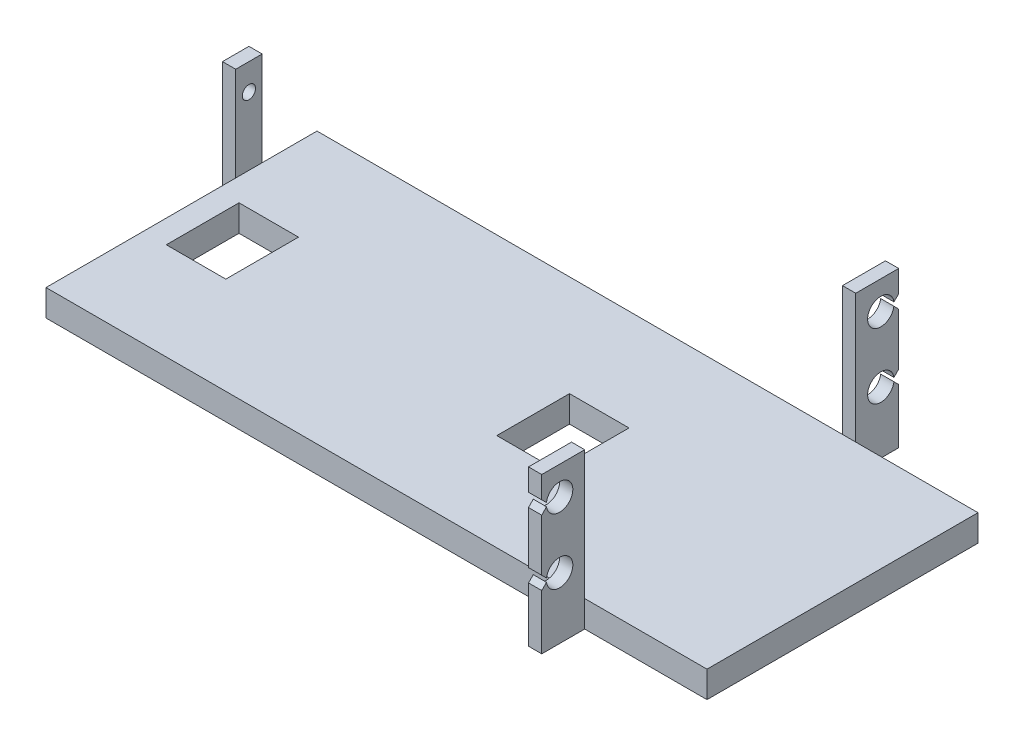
ISO-10303-21;
HEADER;
FILE_DESCRIPTION(('STEP AP214'),'2;1');
FILE_NAME('part.step','',(''),(''),'','','');
FILE_SCHEMA(('AUTOMOTIVE_DESIGN { 1 0 10303 214 1 1 1 1 }'));
ENDSEC;
DATA;
#1=APPLICATION_CONTEXT('core data for automotive mechanical design processes');
#2=APPLICATION_PROTOCOL_DEFINITION('international standard','automotive_design',2000,#1);
#3=PRODUCT_CONTEXT('',#1,'mechanical');
#4=PRODUCT('Part','Part','',(#3));
#5=PRODUCT_RELATED_PRODUCT_CATEGORY('part','',(#4));
#6=PRODUCT_DEFINITION_FORMATION('','',#4);
#7=PRODUCT_DEFINITION_CONTEXT('part definition',#1,'design');
#8=PRODUCT_DEFINITION('design','',#6,#7);
#9=PRODUCT_DEFINITION_SHAPE('','',#8);
#10=(LENGTH_UNIT() NAMED_UNIT(*) SI_UNIT(.MILLI.,.METRE.));
#11=(NAMED_UNIT(*) PLANE_ANGLE_UNIT() SI_UNIT($,.RADIAN.));
#12=(NAMED_UNIT(*) SI_UNIT($,.STERADIAN.) SOLID_ANGLE_UNIT());
#13=UNCERTAINTY_MEASURE_WITH_UNIT(LENGTH_MEASURE(1.E-05),#10,'distance_accuracy_value','');
#14=(GEOMETRIC_REPRESENTATION_CONTEXT(3) GLOBAL_UNCERTAINTY_ASSIGNED_CONTEXT((#13)) GLOBAL_UNIT_ASSIGNED_CONTEXT((#10,
#11,#12)) REPRESENTATION_CONTEXT('',''));
#15=CARTESIAN_POINT('',(0.,0.,0.));
#16=DIRECTION('',(0.,0.,1.));
#17=DIRECTION('',(1.,0.,0.));
#18=AXIS2_PLACEMENT_3D('',#15,#16,#17);
#19=CARTESIAN_POINT('',(0.,4.,0.));
#20=DIRECTION('',(0.,1.,0.));
#21=DIRECTION('',(0.,0.,1.));
#22=AXIS2_PLACEMENT_3D('',#19,#20,#21);
#23=PLANE('',#22);
#24=DIRECTION('',(1.,0.,0.));
#25=VECTOR('',#24,1.);
#26=CARTESIAN_POINT('',(53.5,4.,26.3));
#27=LINE('',#26,#25);
#28=CARTESIAN_POINT('',(53.5,4.,26.3));
#29=VERTEX_POINT('',#28);
#30=CARTESIAN_POINT('',(62.5,4.,26.3));
#31=VERTEX_POINT('',#30);
#32=EDGE_CURVE('E742',#29,#31,#27,.T.);
#33=ORIENTED_EDGE('',*,*,#32,.F.);
#34=DIRECTION('',(0.,0.,1.));
#35=VECTOR('',#34,1.);
#36=CARTESIAN_POINT('',(53.5,4.,15.3));
#37=LINE('',#36,#35);
#38=CARTESIAN_POINT('',(53.5,4.,15.3));
#39=VERTEX_POINT('',#38);
#40=EDGE_CURVE('E730',#39,#29,#37,.T.);
#41=ORIENTED_EDGE('',*,*,#40,.F.);
#42=DIRECTION('',(-1.,0.,0.));
#43=VECTOR('',#42,1.);
#44=CARTESIAN_POINT('',(53.5,4.,15.3));
#45=LINE('',#44,#43);
#46=CARTESIAN_POINT('',(62.5,4.,15.3));
#47=VERTEX_POINT('',#46);
#48=EDGE_CURVE('E725',#47,#39,#45,.T.);
#49=ORIENTED_EDGE('',*,*,#48,.F.);
#50=DIRECTION('',(0.,0.,-1.));
#51=VECTOR('',#50,1.);
#52=CARTESIAN_POINT('',(62.5,4.,15.3));
#53=LINE('',#52,#51);
#54=EDGE_CURVE('E739',#31,#47,#53,.T.);
#55=ORIENTED_EDGE('',*,*,#54,.F.);
#56=EDGE_LOOP('',(#33,#41,#49,#55));
#57=FACE_BOUND('',#56,.T.);
#58=DIRECTION('',(1.,0.,0.));
#59=VECTOR('',#58,1.);
#60=CARTESIAN_POINT('',(3.49999999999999,4.,26.3));
#61=LINE('',#60,#59);
#62=CARTESIAN_POINT('',(3.49999999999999,4.,26.3));
#63=VERTEX_POINT('',#62);
#64=CARTESIAN_POINT('',(12.5,4.,26.3));
#65=VERTEX_POINT('',#64);
#66=EDGE_CURVE('E685',#63,#65,#61,.T.);
#67=ORIENTED_EDGE('',*,*,#66,.F.);
#68=DIRECTION('',(0.,0.,1.));
#69=VECTOR('',#68,1.);
#70=CARTESIAN_POINT('',(3.49999999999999,4.,15.3));
#71=LINE('',#70,#69);
#72=CARTESIAN_POINT('',(3.49999999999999,4.,15.3));
#73=VERTEX_POINT('',#72);
#74=EDGE_CURVE('E683',#73,#63,#71,.T.);
#75=ORIENTED_EDGE('',*,*,#74,.F.);
#76=DIRECTION('',(-1.,0.,0.));
#77=VECTOR('',#76,1.);
#78=CARTESIAN_POINT('',(3.49999999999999,4.,15.3));
#79=LINE('',#78,#77);
#80=CARTESIAN_POINT('',(12.5,4.,15.3));
#81=VERTEX_POINT('',#80);
#82=EDGE_CURVE('E691',#81,#73,#79,.T.);
#83=ORIENTED_EDGE('',*,*,#82,.F.);
#84=DIRECTION('',(0.,0.,-1.));
#85=VECTOR('',#84,1.);
#86=CARTESIAN_POINT('',(12.5,4.,15.3));
#87=LINE('',#86,#85);
#88=EDGE_CURVE('E688',#65,#81,#87,.T.);
#89=ORIENTED_EDGE('',*,*,#88,.F.);
#90=EDGE_LOOP('',(#67,#75,#83,#89));
#91=FACE_BOUND('',#90,.T.);
#92=DIRECTION('',(0.,0.,1.));
#93=VECTOR('',#92,1.);
#94=CARTESIAN_POINT('',(0.,4.,0.));
#95=LINE('',#94,#93);
#96=CARTESIAN_POINT('',(0.,4.,0.));
#97=VERTEX_POINT('',#96);
#98=CARTESIAN_POINT('',(0.,4.,8.3));
#99=VERTEX_POINT('',#98);
#100=EDGE_CURVE('E745',#97,#99,#95,.T.);
#101=ORIENTED_EDGE('',*,*,#100,.T.);
#102=DIRECTION('',(0.,0.,-1.));
#103=VECTOR('',#102,1.);
#104=CARTESIAN_POINT('',(0.,4.,8.3));
#105=LINE('',#104,#103);
#106=CARTESIAN_POINT('',(0.,4.,12.3));
#107=VERTEX_POINT('',#106);
#108=EDGE_CURVE('E445',#107,#99,#105,.T.);
#109=ORIENTED_EDGE('',*,*,#108,.F.);
#110=CARTESIAN_POINT('',(0.,4.,41.));
#111=VERTEX_POINT('',#110);
#112=EDGE_CURVE('E749',#107,#111,#95,.T.);
#113=ORIENTED_EDGE('',*,*,#112,.T.);
#114=DIRECTION('',(1.,0.,0.));
#115=VECTOR('',#114,1.);
#116=CARTESIAN_POINT('',(0.,4.,41.));
#117=LINE('',#116,#115);
#118=CARTESIAN_POINT('',(79.5,4.,41.));
#119=VERTEX_POINT('',#118);
#120=EDGE_CURVE('E750',#111,#119,#117,.T.);
#121=ORIENTED_EDGE('',*,*,#120,.T.);
#122=DIRECTION('',(-1.,0.,0.));
#123=VECTOR('',#122,1.);
#124=CARTESIAN_POINT('',(79.5,4.,41.));
#125=LINE('',#124,#123);
#126=CARTESIAN_POINT('',(81.5,4.,41.));
#127=VERTEX_POINT('',#126);
#128=EDGE_CURVE('E639',#127,#119,#125,.T.);
#129=ORIENTED_EDGE('',*,*,#128,.F.);
#130=CARTESIAN_POINT('',(100.,4.,41.));
#131=VERTEX_POINT('',#130);
#132=EDGE_CURVE('E748',#127,#131,#117,.T.);
#133=ORIENTED_EDGE('',*,*,#132,.T.);
#134=DIRECTION('',(0.,0.,-1.));
#135=VECTOR('',#134,1.);
#136=CARTESIAN_POINT('',(100.,4.,0.));
#137=LINE('',#136,#135);
#138=CARTESIAN_POINT('',(100.,4.,0.));
#139=VERTEX_POINT('',#138);
#140=EDGE_CURVE('E752',#131,#139,#137,.T.);
#141=ORIENTED_EDGE('',*,*,#140,.T.);
#142=DIRECTION('',(-1.,0.,0.));
#143=VECTOR('',#142,1.);
#144=CARTESIAN_POINT('',(0.,4.,0.));
#145=LINE('',#144,#143);
#146=CARTESIAN_POINT('',(81.5,4.,0.));
#147=VERTEX_POINT('',#146);
#148=EDGE_CURVE('E755',#139,#147,#145,.T.);
#149=ORIENTED_EDGE('',*,*,#148,.T.);
#150=DIRECTION('',(-1.,0.,0.));
#151=VECTOR('',#150,1.);
#152=CARTESIAN_POINT('',(79.5,4.,0.));
#153=LINE('',#152,#151);
#154=CARTESIAN_POINT('',(79.5,4.,0.));
#155=VERTEX_POINT('',#154);
#156=EDGE_CURVE('E563',#147,#155,#153,.T.);
#157=ORIENTED_EDGE('',*,*,#156,.T.);
#158=EDGE_CURVE('E754',#155,#97,#145,.T.);
#159=ORIENTED_EDGE('',*,*,#158,.T.);
#160=EDGE_LOOP('',(#101,#109,#113,#121,#129,#133,#141,#149,#157,#159));
#161=FACE_BOUND('',#160,.T.);
#162=ADVANCED_FACE('F95',(#57,#91,#161),#23,.T.);
#163=CARTESIAN_POINT('',(0.,4.,0.));
#164=DIRECTION('',(1.,0.,0.));
#165=DIRECTION('',(0.,0.,-1.));
#166=AXIS2_PLACEMENT_3D('',#163,#164,#165);
#167=PLANE('',#166);
#168=DIRECTION('',(0.,-1.,0.));
#169=VECTOR('',#168,1.);
#170=CARTESIAN_POINT('',(0.,4.,8.3));
#171=LINE('',#170,#169);
#172=CARTESIAN_POINT('',(0.,0.,8.3));
#173=VERTEX_POINT('',#172);
#174=EDGE_CURVE('E459',#99,#173,#171,.T.);
#175=ORIENTED_EDGE('',*,*,#174,.F.);
#176=ORIENTED_EDGE('',*,*,#100,.F.);
#177=DIRECTION('',(0.,-1.,0.));
#178=VECTOR('',#177,1.);
#179=CARTESIAN_POINT('',(0.,4.,0.));
#180=LINE('',#179,#178);
#181=CARTESIAN_POINT('',(0.,0.,0.));
#182=VERTEX_POINT('',#181);
#183=EDGE_CURVE('E758',#97,#182,#180,.T.);
#184=ORIENTED_EDGE('',*,*,#183,.T.);
#185=DIRECTION('',(0.,0.,1.));
#186=VECTOR('',#185,1.);
#187=CARTESIAN_POINT('',(0.,0.,0.));
#188=LINE('',#187,#186);
#189=EDGE_CURVE('E118',#182,#173,#188,.T.);
#190=ORIENTED_EDGE('',*,*,#189,.T.);
#191=EDGE_LOOP('',(#175,#176,#184,#190));
#192=FACE_BOUND('',#191,.T.);
#193=ADVANCED_FACE('F97',(#192),#167,.F.);
#194=DIRECTION('',(0.,1.,0.));
#195=VECTOR('',#194,1.);
#196=CARTESIAN_POINT('',(0.,4.,12.3));
#197=LINE('',#196,#195);
#198=CARTESIAN_POINT('',(0.,0.,12.3));
#199=VERTEX_POINT('',#198);
#200=EDGE_CURVE('E110',#199,#107,#197,.T.);
#201=ORIENTED_EDGE('',*,*,#200,.F.);
#202=CARTESIAN_POINT('',(0.,0.,41.));
#203=VERTEX_POINT('',#202);
#204=EDGE_CURVE('E715',#199,#203,#188,.T.);
#205=ORIENTED_EDGE('',*,*,#204,.T.);
#206=DIRECTION('',(0.,-1.,0.));
#207=VECTOR('',#206,1.);
#208=CARTESIAN_POINT('',(0.,4.,41.));
#209=LINE('',#208,#207);
#210=EDGE_CURVE('E776',#111,#203,#209,.T.);
#211=ORIENTED_EDGE('',*,*,#210,.F.);
#212=ORIENTED_EDGE('',*,*,#112,.F.);
#213=EDGE_LOOP('',(#201,#205,#211,#212));
#214=FACE_BOUND('',#213,.T.);
#215=ADVANCED_FACE('F888',(#214),#167,.F.);
#216=CARTESIAN_POINT('',(0.,0.,-6.5));
#217=DIRECTION('',(0.,0.,1.));
#218=DIRECTION('',(-1.,0.,0.));
#219=AXIS2_PLACEMENT_3D('',#216,#217,#218);
#220=PLANE('',#219);
#221=DIRECTION('',(0.,1.,0.));
#222=VECTOR('',#221,1.);
#223=CARTESIAN_POINT('',(81.5,4.,-6.5));
#224=LINE('',#223,#222);
#225=CARTESIAN_POINT('',(81.5,10.3,-6.5));
#226=VERTEX_POINT('',#225);
#227=CARTESIAN_POINT('',(81.5,18.1748563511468,-6.5));
#228=VERTEX_POINT('',#227);
#229=EDGE_CURVE('E588',#226,#228,#224,.T.);
#230=ORIENTED_EDGE('',*,*,#229,.F.);
#231=DIRECTION('',(-1.,0.,0.));
#232=VECTOR('',#231,1.);
#233=CARTESIAN_POINT('',(0.,10.3,-6.5));
#234=LINE('',#233,#232);
#235=CARTESIAN_POINT('',(79.5,10.3,-6.5));
#236=VERTEX_POINT('',#235);
#237=EDGE_CURVE('E802',#226,#236,#234,.T.);
#238=ORIENTED_EDGE('',*,*,#237,.T.);
#239=DIRECTION('',(0.,-1.,0.));
#240=VECTOR('',#239,1.);
#241=CARTESIAN_POINT('',(79.5,4.,-6.5));
#242=LINE('',#241,#240);
#243=CARTESIAN_POINT('',(79.5,18.1748563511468,-6.5));
#244=VERTEX_POINT('',#243);
#245=EDGE_CURVE('E597',#244,#236,#242,.T.);
#246=ORIENTED_EDGE('',*,*,#245,.F.);
#247=DIRECTION('',(1.,0.,0.));
#248=VECTOR('',#247,1.);
#249=CARTESIAN_POINT('',(0.,18.1748563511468,-6.5));
#250=LINE('',#249,#248);
#251=EDGE_CURVE('E793',#244,#228,#250,.T.);
#252=ORIENTED_EDGE('',*,*,#251,.T.);
#253=EDGE_LOOP('',(#230,#238,#246,#252));
#254=FACE_BOUND('',#253,.T.);
#255=ADVANCED_FACE('F830',(#254),#220,.F.);
#256=CARTESIAN_POINT('',(81.5,20.1748563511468,-6.5));
#257=VERTEX_POINT('',#256);
#258=CARTESIAN_POINT('',(81.5,23.5,-6.5));
#259=VERTEX_POINT('',#258);
#260=EDGE_CURVE('E589',#257,#259,#224,.T.);
#261=ORIENTED_EDGE('',*,*,#260,.F.);
#262=DIRECTION('',(-1.,0.,0.));
#263=VECTOR('',#262,1.);
#264=CARTESIAN_POINT('',(0.,20.1748563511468,-6.5));
#265=LINE('',#264,#263);
#266=CARTESIAN_POINT('',(79.5,20.1748563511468,-6.5));
#267=VERTEX_POINT('',#266);
#268=EDGE_CURVE('E796',#257,#267,#265,.T.);
#269=ORIENTED_EDGE('',*,*,#268,.T.);
#270=CARTESIAN_POINT('',(79.5,23.5,-6.5));
#271=VERTEX_POINT('',#270);
#272=EDGE_CURVE('E593',#271,#267,#242,.T.);
#273=ORIENTED_EDGE('',*,*,#272,.F.);
#274=DIRECTION('',(1.,0.,0.));
#275=VECTOR('',#274,1.);
#276=CARTESIAN_POINT('',(79.5,23.5,-6.5));
#277=LINE('',#276,#275);
#278=EDGE_CURVE('E573',#271,#259,#277,.T.);
#279=ORIENTED_EDGE('',*,*,#278,.T.);
#280=EDGE_LOOP('',(#261,#269,#273,#279));
#281=FACE_BOUND('',#280,.T.);
#282=ADVANCED_FACE('F908',(#281),#220,.F.);
#283=CARTESIAN_POINT('',(0.,4.,0.));
#284=DIRECTION('',(0.,0.,1.));
#285=DIRECTION('',(1.,0.,0.));
#286=AXIS2_PLACEMENT_3D('',#283,#284,#285);
#287=PLANE('',#286);
#288=DIRECTION('',(-1.,0.,0.));
#289=VECTOR('',#288,1.);
#290=CARTESIAN_POINT('',(0.,0.,0.));
#291=LINE('',#290,#289);
#292=CARTESIAN_POINT('',(100.,0.,0.));
#293=VERTEX_POINT('',#292);
#294=CARTESIAN_POINT('',(81.5,0.,0.));
#295=VERTEX_POINT('',#294);
#296=EDGE_CURVE('E766',#293,#295,#291,.T.);
#297=ORIENTED_EDGE('',*,*,#296,.T.);
#298=DIRECTION('',(0.,1.,0.));
#299=VECTOR('',#298,1.);
#300=CARTESIAN_POINT('',(81.5,4.,0.));
#301=LINE('',#300,#299);
#302=EDGE_CURVE('E583',#295,#147,#301,.T.);
#303=ORIENTED_EDGE('',*,*,#302,.T.);
#304=ORIENTED_EDGE('',*,*,#148,.F.);
#305=DIRECTION('',(0.,-1.,0.));
#306=VECTOR('',#305,1.);
#307=CARTESIAN_POINT('',(100.,4.,0.));
#308=LINE('',#307,#306);
#309=EDGE_CURVE('E770',#139,#293,#308,.T.);
#310=ORIENTED_EDGE('',*,*,#309,.T.);
#311=EDGE_LOOP('',(#297,#303,#304,#310));
#312=FACE_BOUND('',#311,.T.);
#313=ADVANCED_FACE('F849',(#312),#287,.F.);
#314=CARTESIAN_POINT('',(81.5,4.,47.5));
#315=DIRECTION('',(-1.,0.,0.));
#316=DIRECTION('',(0.,0.,1.));
#317=AXIS2_PLACEMENT_3D('',#314,#315,#316);
#318=PLANE('',#317);
#319=DIRECTION('',(0.,-0.707106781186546,0.707106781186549));
#320=VECTOR('',#319,1.);
#321=CARTESIAN_POINT('',(81.5,27.9,27.8999999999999));
#322=LINE('',#321,#320);
#323=CARTESIAN_POINT('',(81.5,9.01973454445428,46.7802654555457));
#324=VERTEX_POINT('',#323);
#325=CARTESIAN_POINT('',(81.5,8.30000000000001,47.5));
#326=VERTEX_POINT('',#325);
#327=EDGE_CURVE('E613',#324,#326,#322,.T.);
#328=ORIENTED_EDGE('',*,*,#327,.T.);
#329=DIRECTION('',(0.,1.,0.));
#330=VECTOR('',#329,1.);
#331=CARTESIAN_POINT('',(81.5,4.,47.5));
#332=LINE('',#331,#330);
#333=CARTESIAN_POINT('',(81.5,0.,47.5));
#334=VERTEX_POINT('',#333);
#335=EDGE_CURVE('E659',#334,#326,#332,.T.);
#336=ORIENTED_EDGE('',*,*,#335,.F.);
#337=DIRECTION('',(0.,0.,-1.));
#338=VECTOR('',#337,1.);
#339=CARTESIAN_POINT('',(81.5,0.,47.5));
#340=LINE('',#339,#338);
#341=CARTESIAN_POINT('',(81.5,0.,41.));
#342=VERTEX_POINT('',#341);
#343=EDGE_CURVE('E671',#334,#342,#340,.T.);
#344=ORIENTED_EDGE('',*,*,#343,.T.);
#345=DIRECTION('',(0.,1.,0.));
#346=VECTOR('',#345,1.);
#347=CARTESIAN_POINT('',(81.5,4.,41.));
#348=LINE('',#347,#346);
#349=EDGE_CURVE('E658',#342,#127,#348,.T.);
#350=ORIENTED_EDGE('',*,*,#349,.T.);
#351=DIRECTION('',(0.,-1.,0.));
#352=VECTOR('',#351,1.);
#353=CARTESIAN_POINT('',(81.5,23.5,41.));
#354=LINE('',#353,#352);
#355=CARTESIAN_POINT('',(81.5,23.5,41.));
#356=VERTEX_POINT('',#355);
#357=EDGE_CURVE('E655',#356,#127,#354,.T.);
#358=ORIENTED_EDGE('',*,*,#357,.F.);
#359=DIRECTION('',(0.,0.,-1.));
#360=VECTOR('',#359,1.);
#361=CARTESIAN_POINT('',(81.5,23.5,47.5));
#362=LINE('',#361,#360);
#363=CARTESIAN_POINT('',(81.5,23.5,47.5));
#364=VERTEX_POINT('',#363);
#365=EDGE_CURVE('E646',#364,#356,#362,.T.);
#366=ORIENTED_EDGE('',*,*,#365,.F.);
#367=CARTESIAN_POINT('',(81.5,20.1748563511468,47.5));
#368=VERTEX_POINT('',#367);
#369=EDGE_CURVE('E664',#368,#364,#332,.T.);
#370=ORIENTED_EDGE('',*,*,#369,.F.);
#371=DIRECTION('',(0.,-0.698160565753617,-0.715941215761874));
#372=VECTOR('',#371,1.);
#373=CARTESIAN_POINT('',(81.5,20.1748563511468,47.5));
#374=LINE('',#373,#372);
#375=CARTESIAN_POINT('',(81.5,19.4738691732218,46.7811601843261));
#376=VERTEX_POINT('',#375);
#377=EDGE_CURVE('E610',#368,#376,#374,.T.);
#378=ORIENTED_EDGE('',*,*,#377,.T.);
#379=CARTESIAN_POINT('',(81.5,19.2,44.8));
#380=DIRECTION('',(1.,0.,0.));
#381=DIRECTION('',(0.,0.,-1.));
#382=AXIS2_PLACEMENT_3D('',#379,#380,#381);
#383=CIRCLE('',#382,2.);
#384=CARTESIAN_POINT('',(81.5,18.9137926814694,46.7794154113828));
#385=VERTEX_POINT('',#384);
#386=EDGE_CURVE('E624',#385,#376,#383,.T.);
#387=ORIENTED_EDGE('',*,*,#386,.F.);
#388=DIRECTION('',(0.,-0.715941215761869,0.698160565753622));
#389=VECTOR('',#388,1.);
#390=CARTESIAN_POINT('',(81.5,19.2,46.5003161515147));
#391=LINE('',#390,#389);
#392=CARTESIAN_POINT('',(81.5,18.1748563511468,47.5));
#393=VERTEX_POINT('',#392);
#394=EDGE_CURVE('E621',#385,#393,#391,.T.);
#395=ORIENTED_EDGE('',*,*,#394,.T.);
#396=CARTESIAN_POINT('',(81.5,10.3,47.5));
#397=VERTEX_POINT('',#396);
#398=EDGE_CURVE('E663',#397,#393,#332,.T.);
#399=ORIENTED_EDGE('',*,*,#398,.F.);
#400=DIRECTION('',(0.,-0.707106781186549,-0.707106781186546));
#401=VECTOR('',#400,1.);
#402=CARTESIAN_POINT('',(81.5,-18.6,18.6000000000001));
#403=LINE('',#402,#401);
#404=CARTESIAN_POINT('',(81.5,9.58026545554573,46.7802654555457));
#405=VERTEX_POINT('',#404);
#406=EDGE_CURVE('E609',#397,#405,#403,.T.);
#407=ORIENTED_EDGE('',*,*,#406,.T.);
#408=CARTESIAN_POINT('',(81.5,9.3,44.8));
#409=DIRECTION('',(1.,0.,0.));
#410=DIRECTION('',(0.,0.,-1.));
#411=AXIS2_PLACEMENT_3D('',#408,#409,#410);
#412=CIRCLE('',#411,2.);
#413=EDGE_CURVE('E606',#324,#405,#412,.T.);
#414=ORIENTED_EDGE('',*,*,#413,.F.);
#415=EDGE_LOOP('',(#328,#336,#344,#350,#358,#366,#370,#378,#387,#395,#399,#407,#414));
#416=FACE_BOUND('',#415,.T.);
#417=ADVANCED_FACE('F863',(#416),#318,.F.);
#418=CARTESIAN_POINT('',(79.5,4.,47.5));
#419=DIRECTION('',(1.,0.,0.));
#420=DIRECTION('',(0.,0.,-1.));
#421=AXIS2_PLACEMENT_3D('',#418,#419,#420);
#422=PLANE('',#421);
#423=DIRECTION('',(0.,-0.707106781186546,0.707106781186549));
#424=VECTOR('',#423,1.);
#425=CARTESIAN_POINT('',(79.5,6.15000000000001,49.65));
#426=LINE('',#425,#424);
#427=CARTESIAN_POINT('',(79.5,9.01973454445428,46.7802654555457));
#428=VERTEX_POINT('',#427);
#429=CARTESIAN_POINT('',(79.5,8.30000000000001,47.5));
#430=VERTEX_POINT('',#429);
#431=EDGE_CURVE('E637',#428,#430,#426,.T.);
#432=ORIENTED_EDGE('',*,*,#431,.F.);
#433=CARTESIAN_POINT('',(79.5,9.3,44.8));
#434=DIRECTION('',(1.,0.,0.));
#435=DIRECTION('',(0.,0.,-1.));
#436=AXIS2_PLACEMENT_3D('',#433,#434,#435);
#437=CIRCLE('',#436,2.);
#438=CARTESIAN_POINT('',(79.5,9.58026545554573,46.7802654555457));
#439=VERTEX_POINT('',#438);
#440=EDGE_CURVE('E790',#428,#439,#437,.T.);
#441=ORIENTED_EDGE('',*,*,#440,.T.);
#442=DIRECTION('',(0.,-0.707106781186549,-0.707106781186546));
#443=VECTOR('',#442,1.);
#444=CARTESIAN_POINT('',(79.5,7.14999999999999,44.35));
#445=LINE('',#444,#443);
#446=CARTESIAN_POINT('',(79.5,10.3,47.5));
#447=VERTEX_POINT('',#446);
#448=EDGE_CURVE('E635',#447,#439,#445,.T.);
#449=ORIENTED_EDGE('',*,*,#448,.F.);
#450=DIRECTION('',(0.,-1.,0.));
#451=VECTOR('',#450,1.);
#452=CARTESIAN_POINT('',(79.5,4.,47.5));
#453=LINE('',#452,#451);
#454=CARTESIAN_POINT('',(79.5,18.1748563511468,47.5));
#455=VERTEX_POINT('',#454);
#456=EDGE_CURVE('E669',#455,#447,#453,.T.);
#457=ORIENTED_EDGE('',*,*,#456,.F.);
#458=DIRECTION('',(0.,-0.715941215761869,0.698160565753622));
#459=VECTOR('',#458,1.);
#460=CARTESIAN_POINT('',(79.5,10.9092243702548,54.5851874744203));
#461=LINE('',#460,#459);
#462=CARTESIAN_POINT('',(79.5,18.9137926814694,46.7794154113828));
#463=VERTEX_POINT('',#462);
#464=EDGE_CURVE('E633',#463,#455,#461,.T.);
#465=ORIENTED_EDGE('',*,*,#464,.F.);
#466=CARTESIAN_POINT('',(79.5,19.2,44.8));
#467=DIRECTION('',(1.,0.,0.));
#468=DIRECTION('',(0.,0.,-1.));
#469=AXIS2_PLACEMENT_3D('',#466,#467,#468);
#470=CIRCLE('',#469,2.);
#471=CARTESIAN_POINT('',(79.5,19.4738691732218,46.7811601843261));
#472=VERTEX_POINT('',#471);
#473=EDGE_CURVE('E787',#463,#472,#470,.T.);
#474=ORIENTED_EDGE('',*,*,#473,.T.);
#475=DIRECTION('',(0.,-0.698160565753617,-0.715941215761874));
#476=VECTOR('',#475,1.);
#477=CARTESIAN_POINT('',(79.5,12.2907756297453,39.4151286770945));
#478=LINE('',#477,#476);
#479=CARTESIAN_POINT('',(79.5,20.1748563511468,47.5));
#480=VERTEX_POINT('',#479);
#481=EDGE_CURVE('E619',#480,#472,#478,.T.);
#482=ORIENTED_EDGE('',*,*,#481,.F.);
#483=CARTESIAN_POINT('',(79.5,23.5,47.5));
#484=VERTEX_POINT('',#483);
#485=EDGE_CURVE('E665',#484,#480,#453,.T.);
#486=ORIENTED_EDGE('',*,*,#485,.F.);
#487=DIRECTION('',(0.,0.,1.));
#488=VECTOR('',#487,1.);
#489=CARTESIAN_POINT('',(79.5,23.5,47.5));
#490=LINE('',#489,#488);
#491=CARTESIAN_POINT('',(79.5,23.5,41.));
#492=VERTEX_POINT('',#491);
#493=EDGE_CURVE('E640',#492,#484,#490,.T.);
#494=ORIENTED_EDGE('',*,*,#493,.F.);
#495=DIRECTION('',(0.,-1.,0.));
#496=VECTOR('',#495,1.);
#497=CARTESIAN_POINT('',(79.5,23.5,41.));
#498=LINE('',#497,#496);
#499=EDGE_CURVE('E650',#492,#119,#498,.T.);
#500=ORIENTED_EDGE('',*,*,#499,.T.);
#501=DIRECTION('',(0.,-1.,0.));
#502=VECTOR('',#501,1.);
#503=CARTESIAN_POINT('',(79.5,4.,41.));
#504=LINE('',#503,#502);
#505=CARTESIAN_POINT('',(79.5,0.,41.));
#506=VERTEX_POINT('',#505);
#507=EDGE_CURVE('E674',#119,#506,#504,.T.);
#508=ORIENTED_EDGE('',*,*,#507,.T.);
#509=DIRECTION('',(0.,0.,-1.));
#510=VECTOR('',#509,1.);
#511=CARTESIAN_POINT('',(79.5,0.,47.5));
#512=LINE('',#511,#510);
#513=CARTESIAN_POINT('',(79.5,0.,47.5));
#514=VERTEX_POINT('',#513);
#515=EDGE_CURVE('E679',#514,#506,#512,.T.);
#516=ORIENTED_EDGE('',*,*,#515,.F.);
#517=EDGE_CURVE('E662',#430,#514,#453,.T.);
#518=ORIENTED_EDGE('',*,*,#517,.F.);
#519=EDGE_LOOP('',(#432,#441,#449,#457,#465,#474,#482,#486,#494,#500,#508,#516,#518));
#520=FACE_BOUND('',#519,.T.);
#521=ADVANCED_FACE('F875',(#520),#422,.F.);
#522=CARTESIAN_POINT('',(0.,0.,47.5));
#523=DIRECTION('',(0.,0.,-1.));
#524=DIRECTION('',(-1.,0.,0.));
#525=AXIS2_PLACEMENT_3D('',#522,#523,#524);
#526=PLANE('',#525);
#527=DIRECTION('',(1.,0.,0.));
#528=VECTOR('',#527,1.);
#529=CARTESIAN_POINT('',(0.,8.30000000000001,47.5));
#530=LINE('',#529,#528);
#531=EDGE_CURVE('E785',#430,#326,#530,.T.);
#532=ORIENTED_EDGE('',*,*,#531,.F.);
#533=ORIENTED_EDGE('',*,*,#517,.T.);
#534=DIRECTION('',(1.,0.,0.));
#535=VECTOR('',#534,1.);
#536=CARTESIAN_POINT('',(81.5,0.,47.5));
#537=LINE('',#536,#535);
#538=EDGE_CURVE('E668',#514,#334,#537,.T.);
#539=ORIENTED_EDGE('',*,*,#538,.T.);
#540=ORIENTED_EDGE('',*,*,#335,.T.);
#541=EDGE_LOOP('',(#532,#533,#539,#540));
#542=FACE_BOUND('',#541,.T.);
#543=ADVANCED_FACE('F869',(#542),#526,.F.);
#544=DIRECTION('',(-1.,0.,0.));
#545=VECTOR('',#544,1.);
#546=CARTESIAN_POINT('',(0.,10.3,47.5));
#547=LINE('',#546,#545);
#548=EDGE_CURVE('E783',#397,#447,#547,.T.);
#549=ORIENTED_EDGE('',*,*,#548,.F.);
#550=ORIENTED_EDGE('',*,*,#398,.T.);
#551=DIRECTION('',(1.,0.,0.));
#552=VECTOR('',#551,1.);
#553=CARTESIAN_POINT('',(0.,18.1748563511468,47.5));
#554=LINE('',#553,#552);
#555=EDGE_CURVE('E781',#455,#393,#554,.T.);
#556=ORIENTED_EDGE('',*,*,#555,.F.);
#557=ORIENTED_EDGE('',*,*,#456,.T.);
#558=EDGE_LOOP('',(#549,#550,#556,#557));
#559=FACE_BOUND('',#558,.T.);
#560=ADVANCED_FACE('F944',(#559),#526,.F.);
#561=DIRECTION('',(-1.,0.,0.));
#562=VECTOR('',#561,1.);
#563=CARTESIAN_POINT('',(0.,20.1748563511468,47.5));
#564=LINE('',#563,#562);
#565=EDGE_CURVE('E779',#368,#480,#564,.T.);
#566=ORIENTED_EDGE('',*,*,#565,.F.);
#567=ORIENTED_EDGE('',*,*,#369,.T.);
#568=DIRECTION('',(1.,0.,0.));
#569=VECTOR('',#568,1.);
#570=CARTESIAN_POINT('',(79.5,23.5,47.5));
#571=LINE('',#570,#569);
#572=EDGE_CURVE('E643',#484,#364,#571,.T.);
#573=ORIENTED_EDGE('',*,*,#572,.F.);
#574=ORIENTED_EDGE('',*,*,#485,.T.);
#575=EDGE_LOOP('',(#566,#567,#573,#574));
#576=FACE_BOUND('',#575,.T.);
#577=ADVANCED_FACE('F938',(#576),#526,.F.);
#578=CARTESIAN_POINT('',(0.,4.,41.));
#579=DIRECTION('',(0.,0.,-1.));
#580=DIRECTION('',(-1.,0.,0.));
#581=AXIS2_PLACEMENT_3D('',#578,#579,#580);
#582=PLANE('',#581);
#583=ORIENTED_EDGE('',*,*,#349,.F.);
#584=DIRECTION('',(1.,0.,0.));
#585=VECTOR('',#584,1.);
#586=CARTESIAN_POINT('',(0.,0.,41.));
#587=LINE('',#586,#585);
#588=CARTESIAN_POINT('',(100.,0.,41.));
#589=VERTEX_POINT('',#588);
#590=EDGE_CURVE('E760',#342,#589,#587,.T.);
#591=ORIENTED_EDGE('',*,*,#590,.T.);
#592=DIRECTION('',(0.,-1.,0.));
#593=VECTOR('',#592,1.);
#594=CARTESIAN_POINT('',(100.,4.,41.));
#595=LINE('',#594,#593);
#596=EDGE_CURVE('E773',#131,#589,#595,.T.);
#597=ORIENTED_EDGE('',*,*,#596,.F.);
#598=ORIENTED_EDGE('',*,*,#132,.F.);
#599=EDGE_LOOP('',(#583,#591,#597,#598));
#600=FACE_BOUND('',#599,.T.);
#601=ADVANCED_FACE('F858',(#600),#582,.F.);
#602=ORIENTED_EDGE('',*,*,#507,.F.);
#603=ORIENTED_EDGE('',*,*,#120,.F.);
#604=ORIENTED_EDGE('',*,*,#210,.T.);
#605=EDGE_CURVE('E761',#203,#506,#587,.T.);
#606=ORIENTED_EDGE('',*,*,#605,.T.);
#607=EDGE_LOOP('',(#602,#603,#604,#606));
#608=FACE_BOUND('',#607,.T.);
#609=ADVANCED_FACE('F881',(#608),#582,.F.);
#610=CARTESIAN_POINT('',(0.,0.,0.));
#611=DIRECTION('',(0.,1.,0.));
#612=DIRECTION('',(0.,0.,1.));
#613=AXIS2_PLACEMENT_3D('',#610,#611,#612);
#614=PLANE('',#613);
#615=DIRECTION('',(-1.,0.,0.));
#616=VECTOR('',#615,1.);
#617=CARTESIAN_POINT('',(18.6742363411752,0.,31.4313302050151));
#618=LINE('',#617,#616);
#619=CARTESIAN_POINT('',(12.5,0.,31.4313302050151));
#620=VERTEX_POINT('',#619);
#621=CARTESIAN_POINT('',(3.49999999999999,0.,31.4313302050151));
#622=VERTEX_POINT('',#621);
#623=EDGE_CURVE('E493',#620,#622,#618,.T.);
#624=ORIENTED_EDGE('',*,*,#623,.T.);
#625=DIRECTION('',(0.,0.,-1.));
#626=VECTOR('',#625,1.);
#627=CARTESIAN_POINT('',(3.49999999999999,0.,36.6305696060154));
#628=LINE('',#627,#626);
#629=CARTESIAN_POINT('',(3.49999999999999,0.,36.6305696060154));
#630=VERTEX_POINT('',#629);
#631=EDGE_CURVE('E486',#630,#622,#628,.T.);
#632=ORIENTED_EDGE('',*,*,#631,.F.);
#633=DIRECTION('',(-1.,0.,0.));
#634=VECTOR('',#633,1.);
#635=CARTESIAN_POINT('',(18.6742363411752,0.,36.6305696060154));
#636=LINE('',#635,#634);
#637=CARTESIAN_POINT('',(12.5,0.,36.6305696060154));
#638=VERTEX_POINT('',#637);
#639=EDGE_CURVE('E496',#638,#630,#636,.T.);
#640=ORIENTED_EDGE('',*,*,#639,.F.);
#641=DIRECTION('',(0.,0.,1.));
#642=VECTOR('',#641,1.);
#643=CARTESIAN_POINT('',(12.5,0.,36.6305696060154));
#644=LINE('',#643,#642);
#645=EDGE_CURVE('E470',#620,#638,#644,.T.);
#646=ORIENTED_EDGE('',*,*,#645,.F.);
#647=EDGE_LOOP('',(#624,#632,#640,#646));
#648=FACE_BOUND('',#647,.T.);
#649=DIRECTION('',(-1.,0.,0.));
#650=VECTOR('',#649,1.);
#651=CARTESIAN_POINT('',(68.6742363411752,0.,31.4313302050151));
#652=LINE('',#651,#650);
#653=CARTESIAN_POINT('',(62.5,0.,31.4313302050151));
#654=VERTEX_POINT('',#653);
#655=CARTESIAN_POINT('',(53.5,0.,31.4313302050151));
#656=VERTEX_POINT('',#655);
#657=EDGE_CURVE('E524',#654,#656,#652,.T.);
#658=ORIENTED_EDGE('',*,*,#657,.T.);
#659=DIRECTION('',(0.,0.,-1.));
#660=VECTOR('',#659,1.);
#661=CARTESIAN_POINT('',(53.5,0.,36.6305696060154));
#662=LINE('',#661,#660);
#663=CARTESIAN_POINT('',(53.5,0.,36.6305696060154));
#664=VERTEX_POINT('',#663);
#665=EDGE_CURVE('E517',#664,#656,#662,.T.);
#666=ORIENTED_EDGE('',*,*,#665,.F.);
#667=DIRECTION('',(-1.,0.,0.));
#668=VECTOR('',#667,1.);
#669=CARTESIAN_POINT('',(68.6742363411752,0.,36.6305696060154));
#670=LINE('',#669,#668);
#671=CARTESIAN_POINT('',(62.5,0.,36.6305696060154));
#672=VERTEX_POINT('',#671);
#673=EDGE_CURVE('E527',#672,#664,#670,.T.);
#674=ORIENTED_EDGE('',*,*,#673,.F.);
#675=DIRECTION('',(0.,0.,1.));
#676=VECTOR('',#675,1.);
#677=CARTESIAN_POINT('',(62.5,0.,36.6305696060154));
#678=LINE('',#677,#676);
#679=EDGE_CURVE('E501',#654,#672,#678,.T.);
#680=ORIENTED_EDGE('',*,*,#679,.F.);
#681=EDGE_LOOP('',(#658,#666,#674,#680));
#682=FACE_BOUND('',#681,.T.);
#683=DIRECTION('',(0.,0.,1.));
#684=VECTOR('',#683,1.);
#685=CARTESIAN_POINT('',(53.5,0.,15.3));
#686=LINE('',#685,#684);
#687=CARTESIAN_POINT('',(53.5,0.,15.3));
#688=VERTEX_POINT('',#687);
#689=CARTESIAN_POINT('',(53.5,0.,26.3));
#690=VERTEX_POINT('',#689);
#691=EDGE_CURVE('E698',#688,#690,#686,.T.);
#692=ORIENTED_EDGE('',*,*,#691,.T.);
#693=DIRECTION('',(1.,0.,0.));
#694=VECTOR('',#693,1.);
#695=CARTESIAN_POINT('',(53.5,0.,26.3));
#696=LINE('',#695,#694);
#697=CARTESIAN_POINT('',(62.5,0.,26.3));
#698=VERTEX_POINT('',#697);
#699=EDGE_CURVE('E733',#690,#698,#696,.T.);
#700=ORIENTED_EDGE('',*,*,#699,.T.);
#701=DIRECTION('',(0.,0.,-1.));
#702=VECTOR('',#701,1.);
#703=CARTESIAN_POINT('',(62.5,0.,15.3));
#704=LINE('',#703,#702);
#705=CARTESIAN_POINT('',(62.5,0.,15.3));
#706=VERTEX_POINT('',#705);
#707=EDGE_CURVE('E729',#698,#706,#704,.T.);
#708=ORIENTED_EDGE('',*,*,#707,.T.);
#709=DIRECTION('',(-1.,0.,0.));
#710=VECTOR('',#709,1.);
#711=CARTESIAN_POINT('',(53.5,0.,15.3));
#712=LINE('',#711,#710);
#713=EDGE_CURVE('E726',#706,#688,#712,.T.);
#714=ORIENTED_EDGE('',*,*,#713,.T.);
#715=EDGE_LOOP('',(#692,#700,#708,#714));
#716=FACE_BOUND('',#715,.T.);
#717=ORIENTED_EDGE('',*,*,#189,.F.);
#718=CARTESIAN_POINT('',(79.5,0.,0.));
#719=VERTEX_POINT('',#718);
#720=EDGE_CURVE('E765',#719,#182,#291,.T.);
#721=ORIENTED_EDGE('',*,*,#720,.F.);
#722=DIRECTION('',(0.,0.,1.));
#723=VECTOR('',#722,1.);
#724=CARTESIAN_POINT('',(79.5,0.,-6.5));
#725=LINE('',#724,#723);
#726=CARTESIAN_POINT('',(79.5,0.,-6.5));
#727=VERTEX_POINT('',#726);
#728=EDGE_CURVE('E596',#727,#719,#725,.T.);
#729=ORIENTED_EDGE('',*,*,#728,.F.);
#730=DIRECTION('',(1.,0.,0.));
#731=VECTOR('',#730,1.);
#732=CARTESIAN_POINT('',(81.5,0.,-6.5));
#733=LINE('',#732,#731);
#734=CARTESIAN_POINT('',(81.5,0.,-6.5));
#735=VERTEX_POINT('',#734);
#736=EDGE_CURVE('E587',#727,#735,#733,.T.);
#737=ORIENTED_EDGE('',*,*,#736,.T.);
#738=DIRECTION('',(0.,0.,1.));
#739=VECTOR('',#738,1.);
#740=CARTESIAN_POINT('',(81.5,0.,-6.5));
#741=LINE('',#740,#739);
#742=EDGE_CURVE('E603',#735,#295,#741,.T.);
#743=ORIENTED_EDGE('',*,*,#742,.T.);
#744=ORIENTED_EDGE('',*,*,#296,.F.);
#745=DIRECTION('',(0.,0.,-1.));
#746=VECTOR('',#745,1.);
#747=CARTESIAN_POINT('',(100.,0.,0.));
#748=LINE('',#747,#746);
#749=EDGE_CURVE('E763',#589,#293,#748,.T.);
#750=ORIENTED_EDGE('',*,*,#749,.F.);
#751=ORIENTED_EDGE('',*,*,#590,.F.);
#752=ORIENTED_EDGE('',*,*,#343,.F.);
#753=ORIENTED_EDGE('',*,*,#538,.F.);
#754=ORIENTED_EDGE('',*,*,#515,.T.);
#755=ORIENTED_EDGE('',*,*,#605,.F.);
#756=ORIENTED_EDGE('',*,*,#204,.F.);
#757=DIRECTION('',(1.,0.,0.));
#758=VECTOR('',#757,1.);
#759=CARTESIAN_POINT('',(-2.,0.,12.3));
#760=LINE('',#759,#758);
#761=CARTESIAN_POINT('',(-2.,0.,12.3));
#762=VERTEX_POINT('',#761);
#763=EDGE_CURVE('E431',#762,#199,#760,.T.);
#764=ORIENTED_EDGE('',*,*,#763,.F.);
#765=DIRECTION('',(0.,0.,1.));
#766=VECTOR('',#765,1.);
#767=CARTESIAN_POINT('',(-2.,0.,8.3));
#768=LINE('',#767,#766);
#769=CARTESIAN_POINT('',(-2.,0.,8.3));
#770=VERTEX_POINT('',#769);
#771=EDGE_CURVE('E427',#770,#762,#768,.T.);
#772=ORIENTED_EDGE('',*,*,#771,.F.);
#773=DIRECTION('',(1.,0.,0.));
#774=VECTOR('',#773,1.);
#775=CARTESIAN_POINT('',(-2.,0.,8.3));
#776=LINE('',#775,#774);
#777=EDGE_CURVE('E467',#770,#173,#776,.T.);
#778=ORIENTED_EDGE('',*,*,#777,.T.);
#779=EDGE_LOOP('',(#717,#721,#729,#737,#743,#744,#750,#751,#752,#753,#754,#755,#756,#764,#772,#778));
#780=FACE_BOUND('',#779,.T.);
#781=DIRECTION('',(0.,0.,1.));
#782=VECTOR('',#781,1.);
#783=CARTESIAN_POINT('',(3.49999999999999,0.,15.3));
#784=LINE('',#783,#782);
#785=CARTESIAN_POINT('',(3.49999999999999,0.,15.3));
#786=VERTEX_POINT('',#785);
#787=CARTESIAN_POINT('',(3.49999999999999,0.,26.3));
#788=VERTEX_POINT('',#787);
#789=EDGE_CURVE('E694',#786,#788,#784,.T.);
#790=ORIENTED_EDGE('',*,*,#789,.T.);
#791=DIRECTION('',(1.,0.,0.));
#792=VECTOR('',#791,1.);
#793=CARTESIAN_POINT('',(3.49999999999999,0.,26.3));
#794=LINE('',#793,#792);
#795=CARTESIAN_POINT('',(12.5,0.,26.3));
#796=VERTEX_POINT('',#795);
#797=EDGE_CURVE('E697',#788,#796,#794,.T.);
#798=ORIENTED_EDGE('',*,*,#797,.T.);
#799=DIRECTION('',(0.,0.,-1.));
#800=VECTOR('',#799,1.);
#801=CARTESIAN_POINT('',(12.5,0.,15.3));
#802=LINE('',#801,#800);
#803=CARTESIAN_POINT('',(12.5,0.,15.3));
#804=VERTEX_POINT('',#803);
#805=EDGE_CURVE('E701',#796,#804,#802,.T.);
#806=ORIENTED_EDGE('',*,*,#805,.T.);
#807=DIRECTION('',(-1.,0.,0.));
#808=VECTOR('',#807,1.);
#809=CARTESIAN_POINT('',(3.49999999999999,0.,15.3));
#810=LINE('',#809,#808);
#811=EDGE_CURVE('E686',#804,#786,#810,.T.);
#812=ORIENTED_EDGE('',*,*,#811,.T.);
#813=EDGE_LOOP('',(#790,#798,#806,#812));
#814=FACE_BOUND('',#813,.T.);
#815=ADVANCED_FACE('F839',(#648,#682,#716,#780,#814),#614,.F.);
#816=CARTESIAN_POINT('',(100.,4.,0.));
#817=DIRECTION('',(-1.,0.,0.));
#818=DIRECTION('',(0.,0.,1.));
#819=AXIS2_PLACEMENT_3D('',#816,#817,#818);
#820=PLANE('',#819);
#821=ORIENTED_EDGE('',*,*,#749,.T.);
#822=ORIENTED_EDGE('',*,*,#309,.F.);
#823=ORIENTED_EDGE('',*,*,#140,.F.);
#824=ORIENTED_EDGE('',*,*,#596,.T.);
#825=EDGE_LOOP('',(#821,#822,#823,#824));
#826=FACE_BOUND('',#825,.T.);
#827=ADVANCED_FACE('F854',(#826),#820,.F.);
#828=ORIENTED_EDGE('',*,*,#158,.F.);
#829=DIRECTION('',(0.,-1.,0.));
#830=VECTOR('',#829,1.);
#831=CARTESIAN_POINT('',(79.5,4.,0.));
#832=LINE('',#831,#830);
#833=EDGE_CURVE('E599',#155,#719,#832,.T.);
#834=ORIENTED_EDGE('',*,*,#833,.T.);
#835=ORIENTED_EDGE('',*,*,#720,.T.);
#836=ORIENTED_EDGE('',*,*,#183,.F.);
#837=EDGE_LOOP('',(#828,#834,#835,#836));
#838=FACE_BOUND('',#837,.T.);
#839=ADVANCED_FACE('F898',(#838),#287,.F.);
#840=CARTESIAN_POINT('',(53.5,4.,15.3));
#841=DIRECTION('',(1.,0.,0.));
#842=DIRECTION('',(0.,0.,-1.));
#843=AXIS2_PLACEMENT_3D('',#840,#841,#842);
#844=PLANE('',#843);
#845=ORIENTED_EDGE('',*,*,#691,.F.);
#846=DIRECTION('',(0.,-1.,0.));
#847=VECTOR('',#846,1.);
#848=CARTESIAN_POINT('',(53.5,4.,15.3));
#849=LINE('',#848,#847);
#850=EDGE_CURVE('E722',#39,#688,#849,.T.);
#851=ORIENTED_EDGE('',*,*,#850,.F.);
#852=ORIENTED_EDGE('',*,*,#40,.T.);
#853=DIRECTION('',(0.,-1.,0.));
#854=VECTOR('',#853,1.);
#855=CARTESIAN_POINT('',(53.5,4.,26.3));
#856=LINE('',#855,#854);
#857=EDGE_CURVE('E682',#29,#690,#856,.T.);
#858=ORIENTED_EDGE('',*,*,#857,.T.);
#859=EDGE_LOOP('',(#845,#851,#852,#858));
#860=FACE_BOUND('',#859,.T.);
#861=ADVANCED_FACE('F935',(#860),#844,.T.);
#862=CARTESIAN_POINT('',(53.5,4.,26.3));
#863=DIRECTION('',(0.,0.,-1.));
#864=DIRECTION('',(-1.,0.,0.));
#865=AXIS2_PLACEMENT_3D('',#862,#863,#864);
#866=PLANE('',#865);
#867=ORIENTED_EDGE('',*,*,#699,.F.);
#868=ORIENTED_EDGE('',*,*,#857,.F.);
#869=ORIENTED_EDGE('',*,*,#32,.T.);
#870=DIRECTION('',(0.,-1.,0.));
#871=VECTOR('',#870,1.);
#872=CARTESIAN_POINT('',(62.5,4.,26.3));
#873=LINE('',#872,#871);
#874=EDGE_CURVE('E718',#31,#698,#873,.T.);
#875=ORIENTED_EDGE('',*,*,#874,.T.);
#876=EDGE_LOOP('',(#867,#868,#869,#875));
#877=FACE_BOUND('',#876,.T.);
#878=ADVANCED_FACE('F982',(#877),#866,.T.);
#879=CARTESIAN_POINT('',(62.5,4.,15.3));
#880=DIRECTION('',(-1.,0.,0.));
#881=DIRECTION('',(0.,0.,1.));
#882=AXIS2_PLACEMENT_3D('',#879,#880,#881);
#883=PLANE('',#882);
#884=ORIENTED_EDGE('',*,*,#707,.F.);
#885=ORIENTED_EDGE('',*,*,#874,.F.);
#886=ORIENTED_EDGE('',*,*,#54,.T.);
#887=DIRECTION('',(0.,-1.,0.));
#888=VECTOR('',#887,1.);
#889=CARTESIAN_POINT('',(62.5,4.,15.3));
#890=LINE('',#889,#888);
#891=EDGE_CURVE('E720',#47,#706,#890,.T.);
#892=ORIENTED_EDGE('',*,*,#891,.T.);
#893=EDGE_LOOP('',(#884,#885,#886,#892));
#894=FACE_BOUND('',#893,.T.);
#895=ADVANCED_FACE('F985',(#894),#883,.T.);
#896=CARTESIAN_POINT('',(53.5,4.,15.3));
#897=DIRECTION('',(0.,0.,1.));
#898=DIRECTION('',(1.,0.,0.));
#899=AXIS2_PLACEMENT_3D('',#896,#897,#898);
#900=PLANE('',#899);
#901=ORIENTED_EDGE('',*,*,#713,.F.);
#902=ORIENTED_EDGE('',*,*,#891,.F.);
#903=ORIENTED_EDGE('',*,*,#48,.T.);
#904=ORIENTED_EDGE('',*,*,#850,.T.);
#905=EDGE_LOOP('',(#901,#902,#903,#904));
#906=FACE_BOUND('',#905,.T.);
#907=ADVANCED_FACE('F930',(#906),#900,.T.);
#908=CARTESIAN_POINT('',(3.49999999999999,4.,15.3));
#909=DIRECTION('',(1.,0.,0.));
#910=DIRECTION('',(0.,0.,-1.));
#911=AXIS2_PLACEMENT_3D('',#908,#909,#910);
#912=PLANE('',#911);
#913=ORIENTED_EDGE('',*,*,#789,.F.);
#914=DIRECTION('',(0.,-1.,0.));
#915=VECTOR('',#914,1.);
#916=CARTESIAN_POINT('',(3.49999999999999,4.,15.3));
#917=LINE('',#916,#915);
#918=EDGE_CURVE('E693',#73,#786,#917,.T.);
#919=ORIENTED_EDGE('',*,*,#918,.F.);
#920=ORIENTED_EDGE('',*,*,#74,.T.);
#921=DIRECTION('',(0.,-1.,0.));
#922=VECTOR('',#921,1.);
#923=CARTESIAN_POINT('',(3.49999999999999,4.,26.3));
#924=LINE('',#923,#922);
#925=EDGE_CURVE('E712',#63,#788,#924,.T.);
#926=ORIENTED_EDGE('',*,*,#925,.T.);
#927=EDGE_LOOP('',(#913,#919,#920,#926));
#928=FACE_BOUND('',#927,.T.);
#929=ADVANCED_FACE('F975',(#928),#912,.T.);
#930=CARTESIAN_POINT('',(3.49999999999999,4.,26.3));
#931=DIRECTION('',(0.,0.,-1.));
#932=DIRECTION('',(-1.,0.,0.));
#933=AXIS2_PLACEMENT_3D('',#930,#931,#932);
#934=PLANE('',#933);
#935=ORIENTED_EDGE('',*,*,#797,.F.);
#936=ORIENTED_EDGE('',*,*,#925,.F.);
#937=ORIENTED_EDGE('',*,*,#66,.T.);
#938=DIRECTION('',(0.,-1.,0.));
#939=VECTOR('',#938,1.);
#940=CARTESIAN_POINT('',(12.5,4.,26.3));
#941=LINE('',#940,#939);
#942=EDGE_CURVE('E710',#65,#796,#941,.T.);
#943=ORIENTED_EDGE('',*,*,#942,.T.);
#944=EDGE_LOOP('',(#935,#936,#937,#943));
#945=FACE_BOUND('',#944,.T.);
#946=ADVANCED_FACE('F971',(#945),#934,.T.);
#947=CARTESIAN_POINT('',(12.5,4.,15.3));
#948=DIRECTION('',(-1.,0.,0.));
#949=DIRECTION('',(0.,0.,1.));
#950=AXIS2_PLACEMENT_3D('',#947,#948,#949);
#951=PLANE('',#950);
#952=ORIENTED_EDGE('',*,*,#805,.F.);
#953=ORIENTED_EDGE('',*,*,#942,.F.);
#954=ORIENTED_EDGE('',*,*,#88,.T.);
#955=DIRECTION('',(0.,-1.,0.));
#956=VECTOR('',#955,1.);
#957=CARTESIAN_POINT('',(12.5,4.,15.3));
#958=LINE('',#957,#956);
#959=EDGE_CURVE('E708',#81,#804,#958,.T.);
#960=ORIENTED_EDGE('',*,*,#959,.T.);
#961=EDGE_LOOP('',(#952,#953,#954,#960));
#962=FACE_BOUND('',#961,.T.);
#963=ADVANCED_FACE('F967',(#962),#951,.T.);
#964=CARTESIAN_POINT('',(3.49999999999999,4.,15.3));
#965=DIRECTION('',(0.,0.,1.));
#966=DIRECTION('',(1.,0.,0.));
#967=AXIS2_PLACEMENT_3D('',#964,#965,#966);
#968=PLANE('',#967);
#969=ORIENTED_EDGE('',*,*,#811,.F.);
#970=ORIENTED_EDGE('',*,*,#959,.F.);
#971=ORIENTED_EDGE('',*,*,#82,.T.);
#972=ORIENTED_EDGE('',*,*,#918,.T.);
#973=EDGE_LOOP('',(#969,#970,#971,#972));
#974=FACE_BOUND('',#973,.T.);
#975=ADVANCED_FACE('F964',(#974),#968,.T.);
#976=CARTESIAN_POINT('',(79.5,23.5,41.));
#977=DIRECTION('',(0.,0.,1.));
#978=DIRECTION('',(1.,0.,0.));
#979=AXIS2_PLACEMENT_3D('',#976,#977,#978);
#980=PLANE('',#979);
#981=ORIENTED_EDGE('',*,*,#128,.T.);
#982=ORIENTED_EDGE('',*,*,#499,.F.);
#983=DIRECTION('',(-1.,0.,0.));
#984=VECTOR('',#983,1.);
#985=CARTESIAN_POINT('',(79.5,23.5,41.));
#986=LINE('',#985,#984);
#987=EDGE_CURVE('E648',#356,#492,#986,.T.);
#988=ORIENTED_EDGE('',*,*,#987,.F.);
#989=ORIENTED_EDGE('',*,*,#357,.T.);
#990=EDGE_LOOP('',(#981,#982,#988,#989));
#991=FACE_BOUND('',#990,.T.);
#992=ADVANCED_FACE('F884',(#991),#980,.F.);
#993=CARTESIAN_POINT('',(0.,23.5,0.));
#994=DIRECTION('',(0.,-1.,0.));
#995=DIRECTION('',(0.,0.,-1.));
#996=AXIS2_PLACEMENT_3D('',#993,#994,#995);
#997=PLANE('',#996);
#998=ORIENTED_EDGE('',*,*,#493,.T.);
#999=ORIENTED_EDGE('',*,*,#572,.T.);
#1000=ORIENTED_EDGE('',*,*,#365,.T.);
#1001=ORIENTED_EDGE('',*,*,#987,.T.);
#1002=EDGE_LOOP('',(#998,#999,#1000,#1001));
#1003=FACE_BOUND('',#1002,.T.);
#1004=ADVANCED_FACE('F1043',(#1003),#997,.F.);
#1005=CARTESIAN_POINT('',(62.,19.2,44.8));
#1006=DIRECTION('',(1.,0.,0.));
#1007=DIRECTION('',(0.,0.,-1.));
#1008=AXIS2_PLACEMENT_3D('',#1005,#1006,#1007);
#1009=CYLINDRICAL_SURFACE('',#1008,2.);
#1010=DIRECTION('',(1.,0.,0.));
#1011=VECTOR('',#1010,1.);
#1012=CARTESIAN_POINT('',(62.,18.9137926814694,46.7794154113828));
#1013=LINE('',#1012,#1011);
#1014=EDGE_CURVE('E627',#463,#385,#1013,.T.);
#1015=ORIENTED_EDGE('',*,*,#1014,.T.);
#1016=ORIENTED_EDGE('',*,*,#386,.T.);
#1017=DIRECTION('',(1.,0.,0.));
#1018=VECTOR('',#1017,1.);
#1019=CARTESIAN_POINT('',(62.,19.4738691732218,46.7811601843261));
#1020=LINE('',#1019,#1018);
#1021=EDGE_CURVE('E605',#472,#376,#1020,.T.);
#1022=ORIENTED_EDGE('',*,*,#1021,.F.);
#1023=ORIENTED_EDGE('',*,*,#473,.F.);
#1024=EDGE_LOOP('',(#1015,#1016,#1022,#1023));
#1025=FACE_BOUND('',#1024,.T.);
#1026=ADVANCED_FACE('F1049',(#1025),#1009,.F.);
#1027=CARTESIAN_POINT('',(62.,19.2,46.5003161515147));
#1028=DIRECTION('',(0.,0.698160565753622,0.715941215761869));
#1029=DIRECTION('',(0.,-0.715941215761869,0.698160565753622));
#1030=AXIS2_PLACEMENT_3D('',#1027,#1028,#1029);
#1031=PLANE('',#1030);
#1032=ORIENTED_EDGE('',*,*,#464,.T.);
#1033=ORIENTED_EDGE('',*,*,#555,.T.);
#1034=ORIENTED_EDGE('',*,*,#394,.F.);
#1035=ORIENTED_EDGE('',*,*,#1014,.F.);
#1036=EDGE_LOOP('',(#1032,#1033,#1034,#1035));
#1037=FACE_BOUND('',#1036,.T.);
#1038=ADVANCED_FACE('F1085',(#1037),#1031,.T.);
#1039=CARTESIAN_POINT('',(62.,20.1748563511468,47.5));
#1040=DIRECTION('',(0.,-0.715941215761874,0.698160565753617));
#1041=DIRECTION('',(0.,-0.698160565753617,-0.715941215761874));
#1042=AXIS2_PLACEMENT_3D('',#1039,#1040,#1041);
#1043=PLANE('',#1042);
#1044=ORIENTED_EDGE('',*,*,#481,.T.);
#1045=ORIENTED_EDGE('',*,*,#1021,.T.);
#1046=ORIENTED_EDGE('',*,*,#377,.F.);
#1047=ORIENTED_EDGE('',*,*,#565,.T.);
#1048=EDGE_LOOP('',(#1044,#1045,#1046,#1047));
#1049=FACE_BOUND('',#1048,.T.);
#1050=ADVANCED_FACE('F1094',(#1049),#1043,.T.);
#1051=CARTESIAN_POINT('',(62.,9.3,44.8));
#1052=DIRECTION('',(1.,0.,0.));
#1053=DIRECTION('',(0.,0.,-1.));
#1054=AXIS2_PLACEMENT_3D('',#1051,#1052,#1053);
#1055=CYLINDRICAL_SURFACE('',#1054,2.);
#1056=DIRECTION('',(1.,0.,0.));
#1057=VECTOR('',#1056,1.);
#1058=CARTESIAN_POINT('',(62.,9.01973454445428,46.7802654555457));
#1059=LINE('',#1058,#1057);
#1060=EDGE_CURVE('E617',#428,#324,#1059,.T.);
#1061=ORIENTED_EDGE('',*,*,#1060,.T.);
#1062=ORIENTED_EDGE('',*,*,#413,.T.);
#1063=DIRECTION('',(1.,0.,0.));
#1064=VECTOR('',#1063,1.);
#1065=CARTESIAN_POINT('',(62.,9.58026545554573,46.7802654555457));
#1066=LINE('',#1065,#1064);
#1067=EDGE_CURVE('E616',#439,#405,#1066,.T.);
#1068=ORIENTED_EDGE('',*,*,#1067,.F.);
#1069=ORIENTED_EDGE('',*,*,#440,.F.);
#1070=EDGE_LOOP('',(#1061,#1062,#1068,#1069));
#1071=FACE_BOUND('',#1070,.T.);
#1072=ADVANCED_FACE('F1103',(#1071),#1055,.F.);
#1073=CARTESIAN_POINT('',(62.,27.9,27.8999999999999));
#1074=DIRECTION('',(0.,0.707106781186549,0.707106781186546));
#1075=DIRECTION('',(0.,-0.707106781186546,0.707106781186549));
#1076=AXIS2_PLACEMENT_3D('',#1073,#1074,#1075);
#1077=PLANE('',#1076);
#1078=ORIENTED_EDGE('',*,*,#431,.T.);
#1079=ORIENTED_EDGE('',*,*,#531,.T.);
#1080=ORIENTED_EDGE('',*,*,#327,.F.);
#1081=ORIENTED_EDGE('',*,*,#1060,.F.);
#1082=EDGE_LOOP('',(#1078,#1079,#1080,#1081));
#1083=FACE_BOUND('',#1082,.T.);
#1084=ADVANCED_FACE('F1112',(#1083),#1077,.T.);
#1085=CARTESIAN_POINT('',(62.,-18.6,18.6000000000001));
#1086=DIRECTION('',(0.,-0.707106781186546,0.707106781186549));
#1087=DIRECTION('',(0.,-0.707106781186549,-0.707106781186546));
#1088=AXIS2_PLACEMENT_3D('',#1085,#1086,#1087);
#1089=PLANE('',#1088);
#1090=ORIENTED_EDGE('',*,*,#448,.T.);
#1091=ORIENTED_EDGE('',*,*,#1067,.T.);
#1092=ORIENTED_EDGE('',*,*,#406,.F.);
#1093=ORIENTED_EDGE('',*,*,#548,.T.);
#1094=EDGE_LOOP('',(#1090,#1091,#1092,#1093));
#1095=FACE_BOUND('',#1094,.T.);
#1096=ADVANCED_FACE('F1121',(#1095),#1089,.T.);
#1097=CARTESIAN_POINT('',(81.5,4.,-6.5));
#1098=DIRECTION('',(1.,0.,0.));
#1099=DIRECTION('',(0.,0.,-1.));
#1100=AXIS2_PLACEMENT_3D('',#1097,#1098,#1099);
#1101=PLANE('',#1100);
#1102=DIRECTION('',(0.,-0.707106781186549,0.707106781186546));
#1103=VECTOR('',#1102,1.);
#1104=CARTESIAN_POINT('',(81.5,-18.6,22.3999999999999));
#1105=LINE('',#1104,#1103);
#1106=CARTESIAN_POINT('',(81.5,9.58026545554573,-5.78026545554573));
#1107=VERTEX_POINT('',#1106);
#1108=EDGE_CURVE('E538',#226,#1107,#1105,.T.);
#1109=ORIENTED_EDGE('',*,*,#1108,.F.);
#1110=ORIENTED_EDGE('',*,*,#229,.T.);
#1111=DIRECTION('',(0.,-0.715941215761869,-0.698160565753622));
#1112=VECTOR('',#1111,1.);
#1113=CARTESIAN_POINT('',(81.5,19.2,-5.50031615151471));
#1114=LINE('',#1113,#1112);
#1115=CARTESIAN_POINT('',(81.5,18.9137926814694,-5.77941541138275));
#1116=VERTEX_POINT('',#1115);
#1117=EDGE_CURVE('E536',#1116,#228,#1114,.T.);
#1118=ORIENTED_EDGE('',*,*,#1117,.F.);
#1119=CARTESIAN_POINT('',(81.5,19.2,-3.8));
#1120=DIRECTION('',(-1.,0.,0.));
#1121=DIRECTION('',(0.,0.,1.));
#1122=AXIS2_PLACEMENT_3D('',#1119,#1120,#1121);
#1123=CIRCLE('',#1122,2.);
#1124=CARTESIAN_POINT('',(81.5,19.4738691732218,-5.78116018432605));
#1125=VERTEX_POINT('',#1124);
#1126=EDGE_CURVE('E544',#1116,#1125,#1123,.T.);
#1127=ORIENTED_EDGE('',*,*,#1126,.T.);
#1128=DIRECTION('',(0.,-0.698160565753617,0.715941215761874));
#1129=VECTOR('',#1128,1.);
#1130=CARTESIAN_POINT('',(81.5,20.1748563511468,-6.5));
#1131=LINE('',#1130,#1129);
#1132=EDGE_CURVE('E511',#257,#1125,#1131,.T.);
#1133=ORIENTED_EDGE('',*,*,#1132,.F.);
#1134=ORIENTED_EDGE('',*,*,#260,.T.);
#1135=DIRECTION('',(0.,0.,1.));
#1136=VECTOR('',#1135,1.);
#1137=CARTESIAN_POINT('',(81.5,23.5,-6.5));
#1138=LINE('',#1137,#1136);
#1139=CARTESIAN_POINT('',(81.5,23.5,0.));
#1140=VERTEX_POINT('',#1139);
#1141=EDGE_CURVE('E570',#259,#1140,#1138,.T.);
#1142=ORIENTED_EDGE('',*,*,#1141,.T.);
#1143=DIRECTION('',(0.,-1.,0.));
#1144=VECTOR('',#1143,1.);
#1145=CARTESIAN_POINT('',(81.5,23.5,0.));
#1146=LINE('',#1145,#1144);
#1147=EDGE_CURVE('E576',#1140,#147,#1146,.T.);
#1148=ORIENTED_EDGE('',*,*,#1147,.T.);
#1149=ORIENTED_EDGE('',*,*,#302,.F.);
#1150=ORIENTED_EDGE('',*,*,#742,.F.);
#1151=CARTESIAN_POINT('',(81.5,8.30000000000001,-6.5));
#1152=VERTEX_POINT('',#1151);
#1153=EDGE_CURVE('E584',#735,#1152,#224,.T.);
#1154=ORIENTED_EDGE('',*,*,#1153,.T.);
#1155=DIRECTION('',(0.,-0.707106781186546,-0.707106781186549));
#1156=VECTOR('',#1155,1.);
#1157=CARTESIAN_POINT('',(81.5,27.9,13.1000000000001));
#1158=LINE('',#1157,#1156);
#1159=CARTESIAN_POINT('',(81.5,9.01973454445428,-5.78026545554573));
#1160=VERTEX_POINT('',#1159);
#1161=EDGE_CURVE('E535',#1160,#1152,#1158,.T.);
#1162=ORIENTED_EDGE('',*,*,#1161,.F.);
#1163=CARTESIAN_POINT('',(81.5,9.3,-3.8));
#1164=DIRECTION('',(-1.,0.,0.));
#1165=DIRECTION('',(0.,0.,1.));
#1166=AXIS2_PLACEMENT_3D('',#1163,#1164,#1165);
#1167=CIRCLE('',#1166,2.);
#1168=EDGE_CURVE('E532',#1160,#1107,#1167,.T.);
#1169=ORIENTED_EDGE('',*,*,#1168,.T.);
#1170=EDGE_LOOP('',(#1109,#1110,#1118,#1127,#1133,#1134,#1142,#1148,#1149,#1150,#1154,#1162,#1169));
#1171=FACE_BOUND('',#1170,.T.);
#1172=ADVANCED_FACE('F824',(#1171),#1101,.T.);
#1173=CARTESIAN_POINT('',(79.5,4.,-6.5));
#1174=DIRECTION('',(-1.,0.,0.));
#1175=DIRECTION('',(0.,0.,1.));
#1176=AXIS2_PLACEMENT_3D('',#1173,#1174,#1175);
#1177=PLANE('',#1176);
#1178=DIRECTION('',(0.,0.707106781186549,-0.707106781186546));
#1179=VECTOR('',#1178,1.);
#1180=CARTESIAN_POINT('',(79.5,7.14999999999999,-3.35));
#1181=LINE('',#1180,#1179);
#1182=CARTESIAN_POINT('',(79.5,9.58026545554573,-5.78026545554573));
#1183=VERTEX_POINT('',#1182);
#1184=EDGE_CURVE('E561',#1183,#236,#1181,.T.);
#1185=ORIENTED_EDGE('',*,*,#1184,.F.);
#1186=CARTESIAN_POINT('',(79.5,9.3,-3.8));
#1187=DIRECTION('',(-1.,0.,0.));
#1188=DIRECTION('',(0.,0.,1.));
#1189=AXIS2_PLACEMENT_3D('',#1186,#1187,#1188);
#1190=CIRCLE('',#1189,2.);
#1191=CARTESIAN_POINT('',(79.5,9.01973454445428,-5.78026545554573));
#1192=VERTEX_POINT('',#1191);
#1193=EDGE_CURVE('E12',#1183,#1192,#1190,.F.);
#1194=ORIENTED_EDGE('',*,*,#1193,.T.);
#1195=DIRECTION('',(0.,0.707106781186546,0.707106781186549));
#1196=VECTOR('',#1195,1.);
#1197=CARTESIAN_POINT('',(79.5,6.15000000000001,-8.65000000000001));
#1198=LINE('',#1197,#1196);
#1199=CARTESIAN_POINT('',(79.5,8.30000000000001,-6.5));
#1200=VERTEX_POINT('',#1199);
#1201=EDGE_CURVE('E559',#1200,#1192,#1198,.T.);
#1202=ORIENTED_EDGE('',*,*,#1201,.F.);
#1203=EDGE_CURVE('E592',#1200,#727,#242,.T.);
#1204=ORIENTED_EDGE('',*,*,#1203,.T.);
#1205=ORIENTED_EDGE('',*,*,#728,.T.);
#1206=ORIENTED_EDGE('',*,*,#833,.F.);
#1207=DIRECTION('',(0.,-1.,0.));
#1208=VECTOR('',#1207,1.);
#1209=CARTESIAN_POINT('',(79.5,23.5,0.));
#1210=LINE('',#1209,#1208);
#1211=CARTESIAN_POINT('',(79.5,23.5,0.));
#1212=VERTEX_POINT('',#1211);
#1213=EDGE_CURVE('E580',#1212,#155,#1210,.T.);
#1214=ORIENTED_EDGE('',*,*,#1213,.F.);
#1215=DIRECTION('',(0.,0.,-1.));
#1216=VECTOR('',#1215,1.);
#1217=CARTESIAN_POINT('',(79.5,23.5,-6.5));
#1218=LINE('',#1217,#1216);
#1219=EDGE_CURVE('E564',#1212,#271,#1218,.T.);
#1220=ORIENTED_EDGE('',*,*,#1219,.T.);
#1221=ORIENTED_EDGE('',*,*,#272,.T.);
#1222=DIRECTION('',(0.,0.698160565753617,-0.715941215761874));
#1223=VECTOR('',#1222,1.);
#1224=CARTESIAN_POINT('',(79.5,12.2907756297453,1.58487132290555));
#1225=LINE('',#1224,#1223);
#1226=CARTESIAN_POINT('',(79.5,19.4738691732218,-5.78116018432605));
#1227=VERTEX_POINT('',#1226);
#1228=EDGE_CURVE('E557',#1227,#267,#1225,.T.);
#1229=ORIENTED_EDGE('',*,*,#1228,.F.);
#1230=CARTESIAN_POINT('',(79.5,19.2,-3.8));
#1231=DIRECTION('',(-1.,0.,0.));
#1232=DIRECTION('',(0.,0.,1.));
#1233=AXIS2_PLACEMENT_3D('',#1230,#1231,#1232);
#1234=CIRCLE('',#1233,2.);
#1235=CARTESIAN_POINT('',(79.5,18.9137926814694,-5.77941541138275));
#1236=VERTEX_POINT('',#1235);
#1237=EDGE_CURVE('E103',#1227,#1236,#1234,.F.);
#1238=ORIENTED_EDGE('',*,*,#1237,.T.);
#1239=DIRECTION('',(0.,0.715941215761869,0.698160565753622));
#1240=VECTOR('',#1239,1.);
#1241=CARTESIAN_POINT('',(79.5,10.9092243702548,-13.5851874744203));
#1242=LINE('',#1241,#1240);
#1243=EDGE_CURVE('E554',#244,#1236,#1242,.T.);
#1244=ORIENTED_EDGE('',*,*,#1243,.F.);
#1245=ORIENTED_EDGE('',*,*,#245,.T.);
#1246=EDGE_LOOP('',(#1185,#1194,#1202,#1204,#1205,#1206,#1214,#1220,#1221,#1229,#1238,#1244,#1245));
#1247=FACE_BOUND('',#1246,.T.);
#1248=ADVANCED_FACE('F809',(#1247),#1177,.T.);
#1249=ORIENTED_EDGE('',*,*,#1203,.F.);
#1250=DIRECTION('',(1.,0.,0.));
#1251=VECTOR('',#1250,1.);
#1252=CARTESIAN_POINT('',(0.,8.30000000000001,-6.5));
#1253=LINE('',#1252,#1251);
#1254=EDGE_CURVE('E799',#1200,#1152,#1253,.T.);
#1255=ORIENTED_EDGE('',*,*,#1254,.T.);
#1256=ORIENTED_EDGE('',*,*,#1153,.F.);
#1257=ORIENTED_EDGE('',*,*,#736,.F.);
#1258=EDGE_LOOP('',(#1249,#1255,#1256,#1257));
#1259=FACE_BOUND('',#1258,.T.);
#1260=ADVANCED_FACE('F842',(#1259),#220,.F.);
#1261=CARTESIAN_POINT('',(79.5,23.5,0.));
#1262=DIRECTION('',(0.,0.,1.));
#1263=DIRECTION('',(1.,0.,0.));
#1264=AXIS2_PLACEMENT_3D('',#1261,#1262,#1263);
#1265=PLANE('',#1264);
#1266=ORIENTED_EDGE('',*,*,#156,.F.);
#1267=ORIENTED_EDGE('',*,*,#1147,.F.);
#1268=DIRECTION('',(-1.,0.,0.));
#1269=VECTOR('',#1268,1.);
#1270=CARTESIAN_POINT('',(79.5,23.5,0.));
#1271=LINE('',#1270,#1269);
#1272=EDGE_CURVE('E567',#1140,#1212,#1271,.T.);
#1273=ORIENTED_EDGE('',*,*,#1272,.T.);
#1274=ORIENTED_EDGE('',*,*,#1213,.T.);
#1275=EDGE_LOOP('',(#1266,#1267,#1273,#1274));
#1276=FACE_BOUND('',#1275,.T.);
#1277=ADVANCED_FACE('F906',(#1276),#1265,.T.);
#1278=CARTESIAN_POINT('',(0.,23.5,41.));
#1279=DIRECTION('',(0.,-1.,0.));
#1280=DIRECTION('',(0.,0.,1.));
#1281=AXIS2_PLACEMENT_3D('',#1278,#1279,#1280);
#1282=PLANE('',#1281);
#1283=ORIENTED_EDGE('',*,*,#1219,.F.);
#1284=ORIENTED_EDGE('',*,*,#1272,.F.);
#1285=ORIENTED_EDGE('',*,*,#1141,.F.);
#1286=ORIENTED_EDGE('',*,*,#278,.F.);
#1287=EDGE_LOOP('',(#1283,#1284,#1285,#1286));
#1288=FACE_BOUND('',#1287,.T.);
#1289=ADVANCED_FACE('F904',(#1288),#1282,.F.);
#1290=CARTESIAN_POINT('',(62.,19.2,-3.8));
#1291=DIRECTION('',(1.,0.,0.));
#1292=DIRECTION('',(0.,0.,-1.));
#1293=AXIS2_PLACEMENT_3D('',#1290,#1291,#1292);
#1294=CYLINDRICAL_SURFACE('',#1293,2.);
#1295=DIRECTION('',(1.,0.,0.));
#1296=VECTOR('',#1295,1.);
#1297=CARTESIAN_POINT('',(62.,19.4738691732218,-5.78116018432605));
#1298=LINE('',#1297,#1296);
#1299=EDGE_CURVE('E551',#1227,#1125,#1298,.T.);
#1300=ORIENTED_EDGE('',*,*,#1299,.T.);
#1301=ORIENTED_EDGE('',*,*,#1126,.F.);
#1302=DIRECTION('',(1.,0.,0.));
#1303=VECTOR('',#1302,1.);
#1304=CARTESIAN_POINT('',(62.,18.9137926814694,-5.77941541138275));
#1305=LINE('',#1304,#1303);
#1306=EDGE_CURVE('E552',#1236,#1116,#1305,.T.);
#1307=ORIENTED_EDGE('',*,*,#1306,.F.);
#1308=ORIENTED_EDGE('',*,*,#1237,.F.);
#1309=EDGE_LOOP('',(#1300,#1301,#1307,#1308));
#1310=FACE_BOUND('',#1309,.T.);
#1311=ADVANCED_FACE('F815',(#1310),#1294,.F.);
#1312=CARTESIAN_POINT('',(62.,20.1748563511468,-6.5));
#1313=DIRECTION('',(0.,0.715941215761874,0.698160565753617));
#1314=DIRECTION('',(0.,-0.698160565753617,0.715941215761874));
#1315=AXIS2_PLACEMENT_3D('',#1312,#1313,#1314);
#1316=PLANE('',#1315);
#1317=ORIENTED_EDGE('',*,*,#1228,.T.);
#1318=ORIENTED_EDGE('',*,*,#268,.F.);
#1319=ORIENTED_EDGE('',*,*,#1132,.T.);
#1320=ORIENTED_EDGE('',*,*,#1299,.F.);
#1321=EDGE_LOOP('',(#1317,#1318,#1319,#1320));
#1322=FACE_BOUND('',#1321,.T.);
#1323=ADVANCED_FACE('F818',(#1322),#1316,.F.);
#1324=CARTESIAN_POINT('',(62.,19.2,-5.50031615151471));
#1325=DIRECTION('',(0.,-0.698160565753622,0.715941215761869));
#1326=DIRECTION('',(0.,-0.715941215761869,-0.698160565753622));
#1327=AXIS2_PLACEMENT_3D('',#1324,#1325,#1326);
#1328=PLANE('',#1327);
#1329=ORIENTED_EDGE('',*,*,#1243,.T.);
#1330=ORIENTED_EDGE('',*,*,#1306,.T.);
#1331=ORIENTED_EDGE('',*,*,#1117,.T.);
#1332=ORIENTED_EDGE('',*,*,#251,.F.);
#1333=EDGE_LOOP('',(#1329,#1330,#1331,#1332));
#1334=FACE_BOUND('',#1333,.T.);
#1335=ADVANCED_FACE('F828',(#1334),#1328,.F.);
#1336=CARTESIAN_POINT('',(62.,9.3,-3.8));
#1337=DIRECTION('',(1.,0.,0.));
#1338=DIRECTION('',(0.,0.,-1.));
#1339=AXIS2_PLACEMENT_3D('',#1336,#1337,#1338);
#1340=CYLINDRICAL_SURFACE('',#1339,2.);
#1341=DIRECTION('',(1.,0.,0.));
#1342=VECTOR('',#1341,1.);
#1343=CARTESIAN_POINT('',(62.,9.58026545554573,-5.78026545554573));
#1344=LINE('',#1343,#1342);
#1345=EDGE_CURVE('E542',#1183,#1107,#1344,.T.);
#1346=ORIENTED_EDGE('',*,*,#1345,.T.);
#1347=ORIENTED_EDGE('',*,*,#1168,.F.);
#1348=DIRECTION('',(1.,0.,0.));
#1349=VECTOR('',#1348,1.);
#1350=CARTESIAN_POINT('',(62.,9.01973454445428,-5.78026545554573));
#1351=LINE('',#1350,#1349);
#1352=EDGE_CURVE('E541',#1192,#1160,#1351,.T.);
#1353=ORIENTED_EDGE('',*,*,#1352,.F.);
#1354=ORIENTED_EDGE('',*,*,#1193,.F.);
#1355=EDGE_LOOP('',(#1346,#1347,#1353,#1354));
#1356=FACE_BOUND('',#1355,.T.);
#1357=ADVANCED_FACE('F1205',(#1356),#1340,.F.);
#1358=CARTESIAN_POINT('',(62.,-18.6,22.3999999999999));
#1359=DIRECTION('',(0.,0.707106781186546,0.707106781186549));
#1360=DIRECTION('',(0.,-0.707106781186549,0.707106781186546));
#1361=AXIS2_PLACEMENT_3D('',#1358,#1359,#1360);
#1362=PLANE('',#1361);
#1363=ORIENTED_EDGE('',*,*,#1184,.T.);
#1364=ORIENTED_EDGE('',*,*,#237,.F.);
#1365=ORIENTED_EDGE('',*,*,#1108,.T.);
#1366=ORIENTED_EDGE('',*,*,#1345,.F.);
#1367=EDGE_LOOP('',(#1363,#1364,#1365,#1366));
#1368=FACE_BOUND('',#1367,.T.);
#1369=ADVANCED_FACE('F1213',(#1368),#1362,.F.);
#1370=CARTESIAN_POINT('',(62.,27.9,13.1000000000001));
#1371=DIRECTION('',(0.,-0.707106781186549,0.707106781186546));
#1372=DIRECTION('',(0.,-0.707106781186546,-0.707106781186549));
#1373=AXIS2_PLACEMENT_3D('',#1370,#1371,#1372);
#1374=PLANE('',#1373);
#1375=ORIENTED_EDGE('',*,*,#1201,.T.);
#1376=ORIENTED_EDGE('',*,*,#1352,.T.);
#1377=ORIENTED_EDGE('',*,*,#1161,.T.);
#1378=ORIENTED_EDGE('',*,*,#1254,.F.);
#1379=EDGE_LOOP('',(#1375,#1376,#1377,#1378));
#1380=FACE_BOUND('',#1379,.T.);
#1381=ADVANCED_FACE('F1222',(#1380),#1374,.F.);
#1382=CARTESIAN_POINT('',(53.5,0.,0.));
#1383=DIRECTION('',(-1.,0.,0.));
#1384=DIRECTION('',(0.,0.,1.));
#1385=AXIS2_PLACEMENT_3D('',#1382,#1383,#1384);
#1386=PLANE('',#1385);
#1387=DIRECTION('',(0.,-0.274177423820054,0.961679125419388));
#1388=VECTOR('',#1387,1.);
#1389=CARTESIAN_POINT('',(53.5,1.2957795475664,37.));
#1390=LINE('',#1389,#1388);
#1391=CARTESIAN_POINT('',(53.5,2.66666666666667,32.1916043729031));
#1392=VERTEX_POINT('',#1391);
#1393=CARTESIAN_POINT('',(53.5,1.2957795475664,37.));
#1394=VERTEX_POINT('',#1393);
#1395=EDGE_CURVE('E480',#1392,#1394,#1390,.T.);
#1396=ORIENTED_EDGE('',*,*,#1395,.T.);
#1397=DIRECTION('',(0.,-0.961679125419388,-0.274177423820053));
#1398=VECTOR('',#1397,1.);
#1399=CARTESIAN_POINT('',(53.5,1.2957795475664,37.));
#1400=LINE('',#1399,#1398);
#1401=EDGE_CURVE('E514',#1394,#664,#1400,.T.);
#1402=ORIENTED_EDGE('',*,*,#1401,.T.);
#1403=ORIENTED_EDGE('',*,*,#665,.T.);
#1404=DIRECTION('',(0.,0.961679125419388,0.274177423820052));
#1405=VECTOR('',#1404,1.);
#1406=CARTESIAN_POINT('',(53.5,2.66666666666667,32.1916043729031));
#1407=LINE('',#1406,#1405);
#1408=EDGE_CURVE('E519',#656,#1392,#1407,.T.);
#1409=ORIENTED_EDGE('',*,*,#1408,.T.);
#1410=EDGE_LOOP('',(#1396,#1402,#1403,#1409));
#1411=FACE_BOUND('',#1410,.T.);
#1412=ADVANCED_FACE('F1231',(#1411),#1386,.F.);
#1413=CARTESIAN_POINT('',(68.6742363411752,2.66666666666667,32.1916043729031));
#1414=DIRECTION('',(0.,-0.274177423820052,0.961679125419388));
#1415=DIRECTION('',(0.,-0.961679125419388,-0.274177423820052));
#1416=AXIS2_PLACEMENT_3D('',#1413,#1414,#1415);
#1417=PLANE('',#1416);
#1418=DIRECTION('',(-1.,0.,0.));
#1419=VECTOR('',#1418,1.);
#1420=CARTESIAN_POINT('',(68.6742363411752,2.66666666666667,32.1916043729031));
#1421=LINE('',#1420,#1419);
#1422=CARTESIAN_POINT('',(62.5,2.66666666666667,32.1916043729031));
#1423=VERTEX_POINT('',#1422);
#1424=EDGE_CURVE('E522',#1423,#1392,#1421,.T.);
#1425=ORIENTED_EDGE('',*,*,#1424,.T.);
#1426=ORIENTED_EDGE('',*,*,#1408,.F.);
#1427=ORIENTED_EDGE('',*,*,#657,.F.);
#1428=DIRECTION('',(0.,-0.961679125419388,-0.274177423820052));
#1429=VECTOR('',#1428,1.);
#1430=CARTESIAN_POINT('',(62.5,2.66666666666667,32.1916043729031));
#1431=LINE('',#1430,#1429);
#1432=EDGE_CURVE('E505',#1423,#654,#1431,.T.);
#1433=ORIENTED_EDGE('',*,*,#1432,.F.);
#1434=EDGE_LOOP('',(#1425,#1426,#1427,#1433));
#1435=FACE_BOUND('',#1434,.T.);
#1436=ADVANCED_FACE('F1240',(#1435),#1417,.T.);
#1437=CARTESIAN_POINT('',(68.6742363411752,1.2957795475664,37.));
#1438=DIRECTION('',(0.,0.274177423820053,-0.961679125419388));
#1439=DIRECTION('',(0.,0.961679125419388,0.274177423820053));
#1440=AXIS2_PLACEMENT_3D('',#1437,#1438,#1439);
#1441=PLANE('',#1440);
#1442=ORIENTED_EDGE('',*,*,#673,.T.);
#1443=ORIENTED_EDGE('',*,*,#1401,.F.);
#1444=DIRECTION('',(-1.,0.,0.));
#1445=VECTOR('',#1444,1.);
#1446=CARTESIAN_POINT('',(68.6742363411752,1.2957795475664,37.));
#1447=LINE('',#1446,#1445);
#1448=CARTESIAN_POINT('',(62.5,1.2957795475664,37.));
#1449=VERTEX_POINT('',#1448);
#1450=EDGE_CURVE('E529',#1449,#1394,#1447,.T.);
#1451=ORIENTED_EDGE('',*,*,#1450,.F.);
#1452=DIRECTION('',(0.,0.961679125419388,0.274177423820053));
#1453=VECTOR('',#1452,1.);
#1454=CARTESIAN_POINT('',(62.5,1.2957795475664,37.));
#1455=LINE('',#1454,#1453);
#1456=EDGE_CURVE('E504',#672,#1449,#1455,.T.);
#1457=ORIENTED_EDGE('',*,*,#1456,.F.);
#1458=EDGE_LOOP('',(#1442,#1443,#1451,#1457));
#1459=FACE_BOUND('',#1458,.T.);
#1460=ADVANCED_FACE('F1249',(#1459),#1441,.T.);
#1461=CARTESIAN_POINT('',(68.6742363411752,1.2957795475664,37.));
#1462=DIRECTION('',(0.,-0.961679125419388,-0.274177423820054));
#1463=DIRECTION('',(0.,0.274177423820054,-0.961679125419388));
#1464=AXIS2_PLACEMENT_3D('',#1461,#1462,#1463);
#1465=PLANE('',#1464);
#1466=ORIENTED_EDGE('',*,*,#1450,.T.);
#1467=ORIENTED_EDGE('',*,*,#1395,.F.);
#1468=ORIENTED_EDGE('',*,*,#1424,.F.);
#1469=DIRECTION('',(0.,0.274177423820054,-0.961679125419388));
#1470=VECTOR('',#1469,1.);
#1471=CARTESIAN_POINT('',(62.5,1.2957795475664,37.));
#1472=LINE('',#1471,#1470);
#1473=EDGE_CURVE('E508',#1449,#1423,#1472,.T.);
#1474=ORIENTED_EDGE('',*,*,#1473,.F.);
#1475=EDGE_LOOP('',(#1466,#1467,#1468,#1474));
#1476=FACE_BOUND('',#1475,.T.);
#1477=ADVANCED_FACE('F1258',(#1476),#1465,.T.);
#1478=CARTESIAN_POINT('',(62.5,4.,15.3));
#1479=DIRECTION('',(-1.,0.,0.));
#1480=DIRECTION('',(0.,0.,1.));
#1481=AXIS2_PLACEMENT_3D('',#1478,#1479,#1480);
#1482=PLANE('',#1481);
#1483=ORIENTED_EDGE('',*,*,#1456,.T.);
#1484=ORIENTED_EDGE('',*,*,#1473,.T.);
#1485=ORIENTED_EDGE('',*,*,#1432,.T.);
#1486=ORIENTED_EDGE('',*,*,#679,.T.);
#1487=EDGE_LOOP('',(#1483,#1484,#1485,#1486));
#1488=FACE_BOUND('',#1487,.T.);
#1489=ADVANCED_FACE('F1267',(#1488),#1482,.T.);
#1490=CARTESIAN_POINT('',(3.5,0.,0.));
#1491=DIRECTION('',(-1.,0.,0.));
#1492=DIRECTION('',(0.,0.,1.));
#1493=AXIS2_PLACEMENT_3D('',#1490,#1491,#1492);
#1494=PLANE('',#1493);
#1495=DIRECTION('',(0.,-0.274177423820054,0.961679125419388));
#1496=VECTOR('',#1495,1.);
#1497=CARTESIAN_POINT('',(3.49999999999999,1.2957795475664,37.));
#1498=LINE('',#1497,#1496);
#1499=CARTESIAN_POINT('',(3.49999999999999,2.66666666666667,32.1916043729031));
#1500=VERTEX_POINT('',#1499);
#1501=CARTESIAN_POINT('',(3.49999999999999,1.2957795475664,37.));
#1502=VERTEX_POINT('',#1501);
#1503=EDGE_CURVE('E469',#1500,#1502,#1498,.T.);
#1504=ORIENTED_EDGE('',*,*,#1503,.T.);
#1505=DIRECTION('',(0.,-0.961679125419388,-0.274177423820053));
#1506=VECTOR('',#1505,1.);
#1507=CARTESIAN_POINT('',(3.49999999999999,1.2957795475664,37.));
#1508=LINE('',#1507,#1506);
#1509=EDGE_CURVE('E483',#1502,#630,#1508,.T.);
#1510=ORIENTED_EDGE('',*,*,#1509,.T.);
#1511=ORIENTED_EDGE('',*,*,#631,.T.);
#1512=DIRECTION('',(0.,0.961679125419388,0.274177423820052));
#1513=VECTOR('',#1512,1.);
#1514=CARTESIAN_POINT('',(3.49999999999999,2.66666666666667,32.1916043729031));
#1515=LINE('',#1514,#1513);
#1516=EDGE_CURVE('E488',#622,#1500,#1515,.T.);
#1517=ORIENTED_EDGE('',*,*,#1516,.T.);
#1518=EDGE_LOOP('',(#1504,#1510,#1511,#1517));
#1519=FACE_BOUND('',#1518,.T.);
#1520=ADVANCED_FACE('F1276',(#1519),#1494,.F.);
#1521=CARTESIAN_POINT('',(18.6742363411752,2.66666666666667,32.1916043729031));
#1522=DIRECTION('',(0.,-0.274177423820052,0.961679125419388));
#1523=DIRECTION('',(0.,-0.961679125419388,-0.274177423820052));
#1524=AXIS2_PLACEMENT_3D('',#1521,#1522,#1523);
#1525=PLANE('',#1524);
#1526=DIRECTION('',(-1.,0.,0.));
#1527=VECTOR('',#1526,1.);
#1528=CARTESIAN_POINT('',(18.6742363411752,2.66666666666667,32.1916043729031));
#1529=LINE('',#1528,#1527);
#1530=CARTESIAN_POINT('',(12.5,2.66666666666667,32.1916043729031));
#1531=VERTEX_POINT('',#1530);
#1532=EDGE_CURVE('E491',#1531,#1500,#1529,.T.);
#1533=ORIENTED_EDGE('',*,*,#1532,.T.);
#1534=ORIENTED_EDGE('',*,*,#1516,.F.);
#1535=ORIENTED_EDGE('',*,*,#623,.F.);
#1536=DIRECTION('',(0.,-0.961679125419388,-0.274177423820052));
#1537=VECTOR('',#1536,1.);
#1538=CARTESIAN_POINT('',(12.5,2.66666666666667,32.1916043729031));
#1539=LINE('',#1538,#1537);
#1540=EDGE_CURVE('E474',#1531,#620,#1539,.T.);
#1541=ORIENTED_EDGE('',*,*,#1540,.F.);
#1542=EDGE_LOOP('',(#1533,#1534,#1535,#1541));
#1543=FACE_BOUND('',#1542,.T.);
#1544=ADVANCED_FACE('F1285',(#1543),#1525,.T.);
#1545=CARTESIAN_POINT('',(18.6742363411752,1.2957795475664,37.));
#1546=DIRECTION('',(0.,0.274177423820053,-0.961679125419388));
#1547=DIRECTION('',(0.,0.961679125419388,0.274177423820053));
#1548=AXIS2_PLACEMENT_3D('',#1545,#1546,#1547);
#1549=PLANE('',#1548);
#1550=ORIENTED_EDGE('',*,*,#639,.T.);
#1551=ORIENTED_EDGE('',*,*,#1509,.F.);
#1552=DIRECTION('',(-1.,0.,0.));
#1553=VECTOR('',#1552,1.);
#1554=CARTESIAN_POINT('',(18.6742363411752,1.2957795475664,37.));
#1555=LINE('',#1554,#1553);
#1556=CARTESIAN_POINT('',(12.5,1.2957795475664,37.));
#1557=VERTEX_POINT('',#1556);
#1558=EDGE_CURVE('E498',#1557,#1502,#1555,.T.);
#1559=ORIENTED_EDGE('',*,*,#1558,.F.);
#1560=DIRECTION('',(0.,0.961679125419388,0.274177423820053));
#1561=VECTOR('',#1560,1.);
#1562=CARTESIAN_POINT('',(12.5,1.2957795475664,37.));
#1563=LINE('',#1562,#1561);
#1564=EDGE_CURVE('E473',#638,#1557,#1563,.T.);
#1565=ORIENTED_EDGE('',*,*,#1564,.F.);
#1566=EDGE_LOOP('',(#1550,#1551,#1559,#1565));
#1567=FACE_BOUND('',#1566,.T.);
#1568=ADVANCED_FACE('F1294',(#1567),#1549,.T.);
#1569=CARTESIAN_POINT('',(18.6742363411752,1.2957795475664,37.));
#1570=DIRECTION('',(0.,-0.961679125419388,-0.274177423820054));
#1571=DIRECTION('',(0.,0.274177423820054,-0.961679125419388));
#1572=AXIS2_PLACEMENT_3D('',#1569,#1570,#1571);
#1573=PLANE('',#1572);
#1574=ORIENTED_EDGE('',*,*,#1558,.T.);
#1575=ORIENTED_EDGE('',*,*,#1503,.F.);
#1576=ORIENTED_EDGE('',*,*,#1532,.F.);
#1577=DIRECTION('',(0.,0.274177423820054,-0.961679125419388));
#1578=VECTOR('',#1577,1.);
#1579=CARTESIAN_POINT('',(12.5,1.2957795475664,37.));
#1580=LINE('',#1579,#1578);
#1581=EDGE_CURVE('E477',#1557,#1531,#1580,.T.);
#1582=ORIENTED_EDGE('',*,*,#1581,.F.);
#1583=EDGE_LOOP('',(#1574,#1575,#1576,#1582));
#1584=FACE_BOUND('',#1583,.T.);
#1585=ADVANCED_FACE('F1303',(#1584),#1573,.T.);
#1586=CARTESIAN_POINT('',(12.5,4.,15.3));
#1587=DIRECTION('',(-1.,0.,0.));
#1588=DIRECTION('',(0.,0.,1.));
#1589=AXIS2_PLACEMENT_3D('',#1586,#1587,#1588);
#1590=PLANE('',#1589);
#1591=ORIENTED_EDGE('',*,*,#1564,.T.);
#1592=ORIENTED_EDGE('',*,*,#1581,.T.);
#1593=ORIENTED_EDGE('',*,*,#1540,.T.);
#1594=ORIENTED_EDGE('',*,*,#645,.T.);
#1595=EDGE_LOOP('',(#1591,#1592,#1593,#1594));
#1596=FACE_BOUND('',#1595,.T.);
#1597=ADVANCED_FACE('F1312',(#1596),#1590,.T.);
#1598=CARTESIAN_POINT('',(-2.,4.,8.3));
#1599=DIRECTION('',(0.,0.,1.));
#1600=DIRECTION('',(1.,0.,0.));
#1601=AXIS2_PLACEMENT_3D('',#1598,#1599,#1600);
#1602=PLANE('',#1601);
#1603=ORIENTED_EDGE('',*,*,#174,.T.);
#1604=ORIENTED_EDGE('',*,*,#777,.F.);
#1605=DIRECTION('',(0.,-1.,0.));
#1606=VECTOR('',#1605,1.);
#1607=CARTESIAN_POINT('',(-2.,4.,8.3));
#1608=LINE('',#1607,#1606);
#1609=CARTESIAN_POINT('',(-2.,18.25,8.3));
#1610=VERTEX_POINT('',#1609);
#1611=EDGE_CURVE('E460',#1610,#770,#1608,.T.);
#1612=ORIENTED_EDGE('',*,*,#1611,.F.);
#1613=DIRECTION('',(-1.,0.,0.));
#1614=VECTOR('',#1613,1.);
#1615=CARTESIAN_POINT('',(-2.,18.25,8.3));
#1616=LINE('',#1615,#1614);
#1617=CARTESIAN_POINT('',(0.,18.25,8.3));
#1618=VERTEX_POINT('',#1617);
#1619=EDGE_CURVE('E444',#1618,#1610,#1616,.T.);
#1620=ORIENTED_EDGE('',*,*,#1619,.F.);
#1621=DIRECTION('',(0.,-1.,0.));
#1622=VECTOR('',#1621,1.);
#1623=CARTESIAN_POINT('',(0.,18.25,8.3));
#1624=LINE('',#1623,#1622);
#1625=EDGE_CURVE('E454',#1618,#99,#1624,.T.);
#1626=ORIENTED_EDGE('',*,*,#1625,.T.);
#1627=EDGE_LOOP('',(#1603,#1604,#1612,#1620,#1626));
#1628=FACE_BOUND('',#1627,.T.);
#1629=ADVANCED_FACE('F891',(#1628),#1602,.F.);
#1630=CARTESIAN_POINT('',(-2.,4.,12.3));
#1631=DIRECTION('',(0.,0.,-1.));
#1632=DIRECTION('',(-1.,0.,0.));
#1633=AXIS2_PLACEMENT_3D('',#1630,#1631,#1632);
#1634=PLANE('',#1633);
#1635=ORIENTED_EDGE('',*,*,#200,.T.);
#1636=DIRECTION('',(0.,-1.,0.));
#1637=VECTOR('',#1636,1.);
#1638=CARTESIAN_POINT('',(0.,18.25,12.3));
#1639=LINE('',#1638,#1637);
#1640=CARTESIAN_POINT('',(0.,18.25,12.3));
#1641=VERTEX_POINT('',#1640);
#1642=EDGE_CURVE('E436',#1641,#107,#1639,.T.);
#1643=ORIENTED_EDGE('',*,*,#1642,.F.);
#1644=DIRECTION('',(1.,0.,0.));
#1645=VECTOR('',#1644,1.);
#1646=CARTESIAN_POINT('',(-2.,18.25,12.3));
#1647=LINE('',#1646,#1645);
#1648=CARTESIAN_POINT('',(-2.,18.25,12.3));
#1649=VERTEX_POINT('',#1648);
#1650=EDGE_CURVE('E434',#1649,#1641,#1647,.T.);
#1651=ORIENTED_EDGE('',*,*,#1650,.F.);
#1652=DIRECTION('',(0.,1.,0.));
#1653=VECTOR('',#1652,1.);
#1654=CARTESIAN_POINT('',(-2.,4.,12.3));
#1655=LINE('',#1654,#1653);
#1656=EDGE_CURVE('E421',#762,#1649,#1655,.T.);
#1657=ORIENTED_EDGE('',*,*,#1656,.F.);
#1658=ORIENTED_EDGE('',*,*,#763,.T.);
#1659=EDGE_LOOP('',(#1635,#1643,#1651,#1657,#1658));
#1660=FACE_BOUND('',#1659,.T.);
#1661=ADVANCED_FACE('F435',(#1660),#1634,.F.);
#1662=CARTESIAN_POINT('',(-2.,0.,0.));
#1663=DIRECTION('',(-1.,0.,0.));
#1664=DIRECTION('',(0.,0.,1.));
#1665=AXIS2_PLACEMENT_3D('',#1662,#1663,#1664);
#1666=PLANE('',#1665);
#1667=CARTESIAN_POINT('',(-2.,14.25,10.3));
#1668=DIRECTION('',(-1.,0.,0.));
#1669=DIRECTION('',(0.,0.,1.));
#1670=AXIS2_PLACEMENT_3D('',#1667,#1668,#1669);
#1671=CIRCLE('',#1670,1.);
#1672=CARTESIAN_POINT('',(-2.,14.25,11.3));
#1673=VERTEX_POINT('',#1672);
#1674=EDGE_CURVE('E450',#1673,#1673,#1671,.T.);
#1675=ORIENTED_EDGE('',*,*,#1674,.F.);
#1676=EDGE_LOOP('',(#1675));
#1677=FACE_BOUND('',#1676,.T.);
#1678=ORIENTED_EDGE('',*,*,#1611,.T.);
#1679=ORIENTED_EDGE('',*,*,#771,.T.);
#1680=ORIENTED_EDGE('',*,*,#1656,.T.);
#1681=DIRECTION('',(0.,0.,1.));
#1682=VECTOR('',#1681,1.);
#1683=CARTESIAN_POINT('',(-2.,18.25,8.3));
#1684=LINE('',#1683,#1682);
#1685=EDGE_CURVE('E426',#1610,#1649,#1684,.T.);
#1686=ORIENTED_EDGE('',*,*,#1685,.F.);
#1687=EDGE_LOOP('',(#1678,#1679,#1680,#1686));
#1688=FACE_BOUND('',#1687,.T.);
#1689=ADVANCED_FACE('F424',(#1677,#1688),#1666,.T.);
#1690=CARTESIAN_POINT('',(0.,18.25,8.3));
#1691=DIRECTION('',(-1.,0.,0.));
#1692=DIRECTION('',(0.,0.,1.));
#1693=AXIS2_PLACEMENT_3D('',#1690,#1691,#1692);
#1694=PLANE('',#1693);
#1695=CARTESIAN_POINT('',(0.,14.25,10.3));
#1696=DIRECTION('',(-1.,0.,0.));
#1697=DIRECTION('',(0.,0.,1.));
#1698=AXIS2_PLACEMENT_3D('',#1695,#1696,#1697);
#1699=CIRCLE('',#1698,1.);
#1700=CARTESIAN_POINT('',(0.,14.25,11.3));
#1701=VERTEX_POINT('',#1700);
#1702=EDGE_CURVE('E447',#1701,#1701,#1699,.T.);
#1703=ORIENTED_EDGE('',*,*,#1702,.T.);
#1704=EDGE_LOOP('',(#1703));
#1705=FACE_BOUND('',#1704,.T.);
#1706=ORIENTED_EDGE('',*,*,#108,.T.);
#1707=ORIENTED_EDGE('',*,*,#1625,.F.);
#1708=DIRECTION('',(0.,0.,-1.));
#1709=VECTOR('',#1708,1.);
#1710=CARTESIAN_POINT('',(0.,18.25,8.3));
#1711=LINE('',#1710,#1709);
#1712=EDGE_CURVE('E439',#1641,#1618,#1711,.T.);
#1713=ORIENTED_EDGE('',*,*,#1712,.F.);
#1714=ORIENTED_EDGE('',*,*,#1642,.T.);
#1715=EDGE_LOOP('',(#1706,#1707,#1713,#1714));
#1716=FACE_BOUND('',#1715,.T.);
#1717=ADVANCED_FACE('F1358',(#1705,#1716),#1694,.F.);
#1718=CARTESIAN_POINT('',(0.,18.25,0.));
#1719=DIRECTION('',(0.,1.,0.));
#1720=DIRECTION('',(0.,0.,1.));
#1721=AXIS2_PLACEMENT_3D('',#1718,#1719,#1720);
#1722=PLANE('',#1721);
#1723=ORIENTED_EDGE('',*,*,#1685,.T.);
#1724=ORIENTED_EDGE('',*,*,#1650,.T.);
#1725=ORIENTED_EDGE('',*,*,#1712,.T.);
#1726=ORIENTED_EDGE('',*,*,#1619,.T.);
#1727=EDGE_LOOP('',(#1723,#1724,#1725,#1726));
#1728=FACE_BOUND('',#1727,.T.);
#1729=ADVANCED_FACE('F442',(#1728),#1722,.T.);
#1730=CARTESIAN_POINT('',(0.,14.25,10.3));
#1731=DIRECTION('',(-1.,0.,0.));
#1732=DIRECTION('',(0.,0.,1.));
#1733=AXIS2_PLACEMENT_3D('',#1730,#1731,#1732);
#1734=CYLINDRICAL_SURFACE('',#1733,1.);
#1735=ORIENTED_EDGE('',*,*,#1702,.F.);
#1736=EDGE_LOOP('',(#1735));
#1737=FACE_BOUND('',#1736,.T.);
#1738=ORIENTED_EDGE('',*,*,#1674,.T.);
#1739=EDGE_LOOP('',(#1738));
#1740=FACE_BOUND('',#1739,.T.);
#1741=ADVANCED_FACE('F1383',(#1737,#1740),#1734,.F.);
#1742=CLOSED_SHELL('',(#162,#193,#215,#255,#282,#313,#417,#521,#543,#560,#577,#601,#609,#815,
#827,#839,#861,#878,#895,#907,#929,#946,#963,#975,#992,#1004,#1026,#1038,#1050,#1072,#1084,
#1096,#1172,#1248,#1260,#1277,#1289,#1311,#1323,#1335,#1357,#1369,#1381,#1412,#1436,#1460,#1477,
#1489,#1520,#1544,#1568,#1585,#1597,#1629,#1661,#1689,#1717,#1729,#1741));
#1743=MANIFOLD_SOLID_BREP('B2',#1742);
#1744=ADVANCED_BREP_SHAPE_REPRESENTATION('',(#18,#1743),#14);
#1745=SHAPE_DEFINITION_REPRESENTATION(#9,#1744);
ENDSEC;
END-ISO-10303-21;
